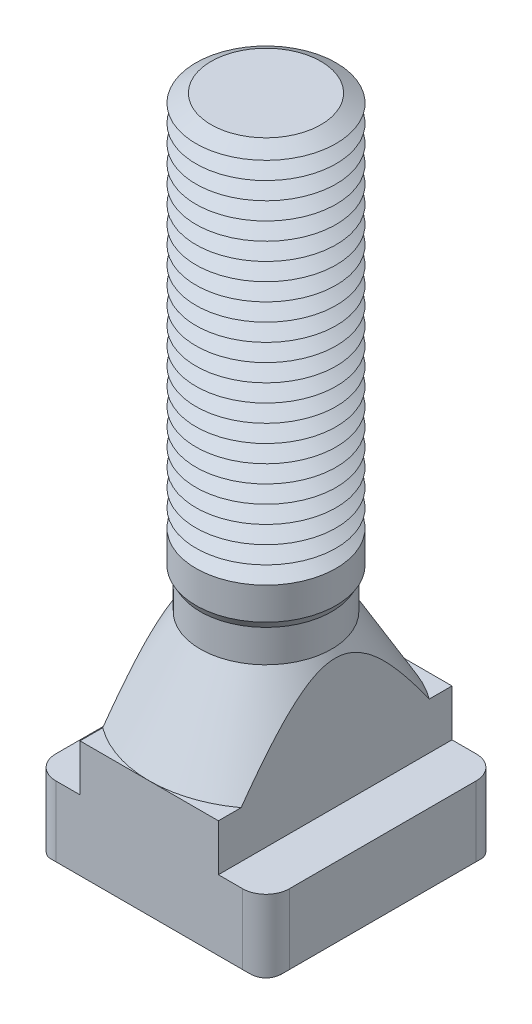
ISO-10303-21;
HEADER;
FILE_DESCRIPTION(('STEP AP214'),'2;1');
FILE_NAME('part.step','',(''),(''),'','','');
FILE_SCHEMA(('AUTOMOTIVE_DESIGN { 1 0 10303 214 1 1 1 1 }'));
ENDSEC;
DATA;
#1=APPLICATION_CONTEXT('core data for automotive mechanical design processes');
#2=APPLICATION_PROTOCOL_DEFINITION('international standard','automotive_design',2000,#1);
#3=PRODUCT_CONTEXT('',#1,'mechanical');
#4=PRODUCT('Part','Part','',(#3));
#5=PRODUCT_RELATED_PRODUCT_CATEGORY('part','',(#4));
#6=PRODUCT_DEFINITION_FORMATION('','',#4);
#7=PRODUCT_DEFINITION_CONTEXT('part definition',#1,'design');
#8=PRODUCT_DEFINITION('design','',#6,#7);
#9=PRODUCT_DEFINITION_SHAPE('','',#8);
#10=(LENGTH_UNIT() NAMED_UNIT(*) SI_UNIT(.MILLI.,.METRE.));
#11=(NAMED_UNIT(*) PLANE_ANGLE_UNIT() SI_UNIT($,.RADIAN.));
#12=(NAMED_UNIT(*) SI_UNIT($,.STERADIAN.) SOLID_ANGLE_UNIT());
#13=UNCERTAINTY_MEASURE_WITH_UNIT(LENGTH_MEASURE(1.E-05),#10,'distance_accuracy_value','');
#14=(GEOMETRIC_REPRESENTATION_CONTEXT(3) GLOBAL_UNCERTAINTY_ASSIGNED_CONTEXT((#13)) GLOBAL_UNIT_ASSIGNED_CONTEXT((#10,
#11,#12)) REPRESENTATION_CONTEXT('',''));
#15=CARTESIAN_POINT('',(0.,0.,0.));
#16=DIRECTION('',(0.,0.,1.));
#17=DIRECTION('',(1.,0.,0.));
#18=AXIS2_PLACEMENT_3D('',#15,#16,#17);
#19=CARTESIAN_POINT('',(0.,104.,0.));
#20=DIRECTION('',(0.,-1.,0.));
#21=DIRECTION('',(0.,0.,-1.));
#22=AXIS2_PLACEMENT_3D('',#19,#20,#21);
#23=CONICAL_SURFACE('',#22,9.40192378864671,1.0471975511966);
#24=CARTESIAN_POINT('',(0.,102.5,0.));
#25=DIRECTION('',(0.,-1.,0.));
#26=DIRECTION('',(0.,0.,-1.));
#27=AXIS2_PLACEMENT_3D('',#24,#25,#26);
#28=CIRCLE('',#27,12.);
#29=CARTESIAN_POINT('',(0.,102.5,-12.));
#30=VERTEX_POINT('',#29);
#31=EDGE_CURVE('E793',#30,#30,#28,.T.);
#32=ORIENTED_EDGE('',*,*,#31,.F.);
#33=EDGE_LOOP('',(#32));
#34=FACE_BOUND('',#33,.T.);
#35=CARTESIAN_POINT('',(0.,104.,0.));
#36=DIRECTION('',(0.,-1.,0.));
#37=DIRECTION('',(0.,0.,-1.));
#38=AXIS2_PLACEMENT_3D('',#35,#36,#37);
#39=CIRCLE('',#38,9.40192378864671);
#40=CARTESIAN_POINT('',(0.,104.,-9.40192378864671));
#41=VERTEX_POINT('',#40);
#42=EDGE_CURVE('E797',#41,#41,#39,.T.);
#43=ORIENTED_EDGE('',*,*,#42,.T.);
#44=EDGE_LOOP('',(#43));
#45=FACE_BOUND('',#44,.T.);
#46=ADVANCED_FACE('F39',(#34,#45),#23,.T.);
#47=CARTESIAN_POINT('',(0.,105.5,0.));
#48=DIRECTION('',(0.,1.,0.));
#49=DIRECTION('',(0.,0.,1.));
#50=AXIS2_PLACEMENT_3D('',#47,#48,#49);
#51=CONICAL_SURFACE('',#50,12.,1.0471975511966);
#52=ORIENTED_EDGE('',*,*,#42,.F.);
#53=EDGE_LOOP('',(#52));
#54=FACE_BOUND('',#53,.T.);
#55=CARTESIAN_POINT('',(0.,105.5,0.));
#56=DIRECTION('',(0.,-1.,0.));
#57=DIRECTION('',(0.,0.,-1.));
#58=AXIS2_PLACEMENT_3D('',#55,#56,#57);
#59=CIRCLE('',#58,12.);
#60=CARTESIAN_POINT('',(0.,105.5,-12.));
#61=VERTEX_POINT('',#60);
#62=EDGE_CURVE('E800',#61,#61,#59,.T.);
#63=ORIENTED_EDGE('',*,*,#62,.T.);
#64=EDGE_LOOP('',(#63));
#65=FACE_BOUND('',#64,.T.);
#66=ADVANCED_FACE('F448',(#54,#65),#51,.T.);
#67=CARTESIAN_POINT('',(4.88720956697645,116.,0.));
#68=DIRECTION('',(0.,-1.,0.));
#69=DIRECTION('',(1.,0.,0.));
#70=AXIS2_PLACEMENT_3D('',#67,#68,#69);
#71=PLANE('',#70);
#72=CARTESIAN_POINT('',(0.,116.,0.));
#73=DIRECTION('',(0.,-1.,0.));
#74=DIRECTION('',(0.,0.,-1.));
#75=AXIS2_PLACEMENT_3D('',#72,#73,#74);
#76=CIRCLE('',#75,9.40192378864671);
#77=CARTESIAN_POINT('',(0.,116.,-9.40192378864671));
#78=VERTEX_POINT('',#77);
#79=EDGE_CURVE('E660',#78,#78,#76,.T.);
#80=ORIENTED_EDGE('',*,*,#79,.F.);
#81=EDGE_LOOP('',(#80));
#82=FACE_BOUND('',#81,.T.);
#83=ADVANCED_FACE('F454',(#82),#71,.F.);
#84=CARTESIAN_POINT('',(0.,116.,0.));
#85=DIRECTION('',(0.,-1.,0.));
#86=DIRECTION('',(0.,0.,-1.));
#87=AXIS2_PLACEMENT_3D('',#84,#85,#86);
#88=CONICAL_SURFACE('',#87,9.40192378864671,1.0471975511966);
#89=CARTESIAN_POINT('',(0.,114.5,0.));
#90=DIRECTION('',(0.,-1.,0.));
#91=DIRECTION('',(0.,0.,-1.));
#92=AXIS2_PLACEMENT_3D('',#89,#90,#91);
#93=CIRCLE('',#92,12.);
#94=CARTESIAN_POINT('',(0.,114.5,-12.));
#95=VERTEX_POINT('',#94);
#96=EDGE_CURVE('E663',#95,#95,#93,.T.);
#97=ORIENTED_EDGE('',*,*,#96,.F.);
#98=EDGE_LOOP('',(#97));
#99=FACE_BOUND('',#98,.T.);
#100=ORIENTED_EDGE('',*,*,#79,.T.);
#101=EDGE_LOOP('',(#100));
#102=FACE_BOUND('',#101,.T.);
#103=ADVANCED_FACE('F482',(#99,#102),#88,.T.);
#104=CARTESIAN_POINT('',(0.,114.5,0.));
#105=DIRECTION('',(0.,1.,0.));
#106=DIRECTION('',(0.,0.,1.));
#107=AXIS2_PLACEMENT_3D('',#104,#105,#106);
#108=CONICAL_SURFACE('',#107,12.,1.0471975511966);
#109=CARTESIAN_POINT('',(0.,113.,0.));
#110=DIRECTION('',(0.,-1.,0.));
#111=DIRECTION('',(0.,0.,-1.));
#112=AXIS2_PLACEMENT_3D('',#109,#110,#111);
#113=CIRCLE('',#112,9.40192378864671);
#114=CARTESIAN_POINT('',(0.,113.,-9.40192378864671));
#115=VERTEX_POINT('',#114);
#116=EDGE_CURVE('E679',#115,#115,#113,.T.);
#117=ORIENTED_EDGE('',*,*,#116,.F.);
#118=EDGE_LOOP('',(#117));
#119=FACE_BOUND('',#118,.T.);
#120=ORIENTED_EDGE('',*,*,#96,.T.);
#121=EDGE_LOOP('',(#120));
#122=FACE_BOUND('',#121,.T.);
#123=ADVANCED_FACE('F479',(#119,#122),#108,.T.);
#124=CARTESIAN_POINT('',(0.,113.,0.));
#125=DIRECTION('',(0.,-1.,0.));
#126=DIRECTION('',(0.,0.,-1.));
#127=AXIS2_PLACEMENT_3D('',#124,#125,#126);
#128=CONICAL_SURFACE('',#127,9.40192378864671,1.0471975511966);
#129=CARTESIAN_POINT('',(0.,111.5,0.));
#130=DIRECTION('',(0.,-1.,0.));
#131=DIRECTION('',(0.,0.,-1.));
#132=AXIS2_PLACEMENT_3D('',#129,#130,#131);
#133=CIRCLE('',#132,12.);
#134=CARTESIAN_POINT('',(0.,111.5,-12.));
#135=VERTEX_POINT('',#134);
#136=EDGE_CURVE('E676',#135,#135,#133,.T.);
#137=ORIENTED_EDGE('',*,*,#136,.F.);
#138=EDGE_LOOP('',(#137));
#139=FACE_BOUND('',#138,.T.);
#140=ORIENTED_EDGE('',*,*,#116,.T.);
#141=EDGE_LOOP('',(#140));
#142=FACE_BOUND('',#141,.T.);
#143=ADVANCED_FACE('F474',(#139,#142),#128,.T.);
#144=CARTESIAN_POINT('',(0.,111.5,0.));
#145=DIRECTION('',(0.,1.,0.));
#146=DIRECTION('',(0.,0.,1.));
#147=AXIS2_PLACEMENT_3D('',#144,#145,#146);
#148=CONICAL_SURFACE('',#147,12.,1.0471975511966);
#149=CARTESIAN_POINT('',(0.,110.,0.));
#150=DIRECTION('',(0.,-1.,0.));
#151=DIRECTION('',(0.,0.,-1.));
#152=AXIS2_PLACEMENT_3D('',#149,#150,#151);
#153=CIRCLE('',#152,9.40192378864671);
#154=CARTESIAN_POINT('',(0.,110.,-9.40192378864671));
#155=VERTEX_POINT('',#154);
#156=EDGE_CURVE('E680',#155,#155,#153,.T.);
#157=ORIENTED_EDGE('',*,*,#156,.F.);
#158=EDGE_LOOP('',(#157));
#159=FACE_BOUND('',#158,.T.);
#160=ORIENTED_EDGE('',*,*,#136,.T.);
#161=EDGE_LOOP('',(#160));
#162=FACE_BOUND('',#161,.T.);
#163=ADVANCED_FACE('F471',(#159,#162),#148,.T.);
#164=CARTESIAN_POINT('',(0.,110.,0.));
#165=DIRECTION('',(0.,-1.,0.));
#166=DIRECTION('',(0.,0.,-1.));
#167=AXIS2_PLACEMENT_3D('',#164,#165,#166);
#168=CONICAL_SURFACE('',#167,9.40192378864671,1.0471975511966);
#169=CARTESIAN_POINT('',(0.,108.5,0.));
#170=DIRECTION('',(0.,-1.,0.));
#171=DIRECTION('',(0.,0.,-1.));
#172=AXIS2_PLACEMENT_3D('',#169,#170,#171);
#173=CIRCLE('',#172,12.);
#174=CARTESIAN_POINT('',(0.,108.5,-12.));
#175=VERTEX_POINT('',#174);
#176=EDGE_CURVE('E697',#175,#175,#173,.T.);
#177=ORIENTED_EDGE('',*,*,#176,.F.);
#178=EDGE_LOOP('',(#177));
#179=FACE_BOUND('',#178,.T.);
#180=ORIENTED_EDGE('',*,*,#156,.T.);
#181=EDGE_LOOP('',(#180));
#182=FACE_BOUND('',#181,.T.);
#183=ADVANCED_FACE('F465',(#179,#182),#168,.T.);
#184=CARTESIAN_POINT('',(0.,108.5,0.));
#185=DIRECTION('',(0.,1.,0.));
#186=DIRECTION('',(0.,0.,1.));
#187=AXIS2_PLACEMENT_3D('',#184,#185,#186);
#188=CONICAL_SURFACE('',#187,12.,1.0471975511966);
#189=CARTESIAN_POINT('',(0.,107.,0.));
#190=DIRECTION('',(0.,-1.,0.));
#191=DIRECTION('',(0.,0.,-1.));
#192=AXIS2_PLACEMENT_3D('',#189,#190,#191);
#193=CIRCLE('',#192,9.40192378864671);
#194=CARTESIAN_POINT('',(0.,107.,-9.40192378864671));
#195=VERTEX_POINT('',#194);
#196=EDGE_CURVE('E699',#195,#195,#193,.T.);
#197=ORIENTED_EDGE('',*,*,#196,.F.);
#198=EDGE_LOOP('',(#197));
#199=FACE_BOUND('',#198,.T.);
#200=ORIENTED_EDGE('',*,*,#176,.T.);
#201=EDGE_LOOP('',(#200));
#202=FACE_BOUND('',#201,.T.);
#203=ADVANCED_FACE('F461',(#199,#202),#188,.T.);
#204=CARTESIAN_POINT('',(0.,107.,0.));
#205=DIRECTION('',(0.,-1.,0.));
#206=DIRECTION('',(0.,0.,-1.));
#207=AXIS2_PLACEMENT_3D('',#204,#205,#206);
#208=CONICAL_SURFACE('',#207,9.40192378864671,1.0471975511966);
#209=ORIENTED_EDGE('',*,*,#62,.F.);
#210=EDGE_LOOP('',(#209));
#211=FACE_BOUND('',#210,.T.);
#212=ORIENTED_EDGE('',*,*,#196,.T.);
#213=EDGE_LOOP('',(#212));
#214=FACE_BOUND('',#213,.T.);
#215=ADVANCED_FACE('F464',(#211,#214),#208,.T.);
#216=CARTESIAN_POINT('',(0.,101.,0.));
#217=DIRECTION('',(0.,-1.,0.));
#218=DIRECTION('',(0.,0.,-1.));
#219=AXIS2_PLACEMENT_3D('',#216,#217,#218);
#220=CONICAL_SURFACE('',#219,9.40192378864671,1.0471975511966);
#221=CARTESIAN_POINT('',(0.,99.5,0.));
#222=DIRECTION('',(0.,-1.,0.));
#223=DIRECTION('',(0.,0.,-1.));
#224=AXIS2_PLACEMENT_3D('',#221,#222,#223);
#225=CIRCLE('',#224,12.);
#226=CARTESIAN_POINT('',(0.,99.5,-12.));
#227=VERTEX_POINT('',#226);
#228=EDGE_CURVE('E642',#227,#227,#225,.T.);
#229=ORIENTED_EDGE('',*,*,#228,.F.);
#230=EDGE_LOOP('',(#229));
#231=FACE_BOUND('',#230,.T.);
#232=CARTESIAN_POINT('',(0.,101.,0.));
#233=DIRECTION('',(0.,-1.,0.));
#234=DIRECTION('',(0.,0.,-1.));
#235=AXIS2_PLACEMENT_3D('',#232,#233,#234);
#236=CIRCLE('',#235,9.40192378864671);
#237=CARTESIAN_POINT('',(0.,101.,-9.40192378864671));
#238=VERTEX_POINT('',#237);
#239=EDGE_CURVE('E644',#238,#238,#236,.T.);
#240=ORIENTED_EDGE('',*,*,#239,.T.);
#241=EDGE_LOOP('',(#240));
#242=FACE_BOUND('',#241,.T.);
#243=ADVANCED_FACE('F469',(#231,#242),#220,.T.);
#244=CARTESIAN_POINT('',(0.,102.5,0.));
#245=DIRECTION('',(0.,1.,0.));
#246=DIRECTION('',(0.,0.,1.));
#247=AXIS2_PLACEMENT_3D('',#244,#245,#246);
#248=CONICAL_SURFACE('',#247,12.,1.0471975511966);
#249=ORIENTED_EDGE('',*,*,#239,.F.);
#250=EDGE_LOOP('',(#249));
#251=FACE_BOUND('',#250,.T.);
#252=ORIENTED_EDGE('',*,*,#31,.T.);
#253=EDGE_LOOP('',(#252));
#254=FACE_BOUND('',#253,.T.);
#255=ADVANCED_FACE('F1267',(#251,#254),#248,.T.);
#256=CARTESIAN_POINT('',(0.,98.,0.));
#257=DIRECTION('',(0.,-1.,0.));
#258=DIRECTION('',(0.,0.,-1.));
#259=AXIS2_PLACEMENT_3D('',#256,#257,#258);
#260=CONICAL_SURFACE('',#259,9.40192378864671,1.0471975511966);
#261=CARTESIAN_POINT('',(0.,96.5,0.));
#262=DIRECTION('',(0.,-1.,0.));
#263=DIRECTION('',(0.,0.,-1.));
#264=AXIS2_PLACEMENT_3D('',#261,#262,#263);
#265=CIRCLE('',#264,12.);
#266=CARTESIAN_POINT('',(0.,96.5,-12.));
#267=VERTEX_POINT('',#266);
#268=EDGE_CURVE('E695',#267,#267,#265,.T.);
#269=ORIENTED_EDGE('',*,*,#268,.F.);
#270=EDGE_LOOP('',(#269));
#271=FACE_BOUND('',#270,.T.);
#272=CARTESIAN_POINT('',(0.,98.,0.));
#273=DIRECTION('',(0.,-1.,0.));
#274=DIRECTION('',(0.,0.,-1.));
#275=AXIS2_PLACEMENT_3D('',#272,#273,#274);
#276=CIRCLE('',#275,9.40192378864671);
#277=CARTESIAN_POINT('',(0.,98.,-9.40192378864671));
#278=VERTEX_POINT('',#277);
#279=EDGE_CURVE('E645',#278,#278,#276,.T.);
#280=ORIENTED_EDGE('',*,*,#279,.T.);
#281=EDGE_LOOP('',(#280));
#282=FACE_BOUND('',#281,.T.);
#283=ADVANCED_FACE('F1257',(#271,#282),#260,.T.);
#284=CARTESIAN_POINT('',(0.,99.5,0.));
#285=DIRECTION('',(0.,1.,0.));
#286=DIRECTION('',(0.,0.,1.));
#287=AXIS2_PLACEMENT_3D('',#284,#285,#286);
#288=CONICAL_SURFACE('',#287,12.,1.0471975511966);
#289=ORIENTED_EDGE('',*,*,#279,.F.);
#290=EDGE_LOOP('',(#289));
#291=FACE_BOUND('',#290,.T.);
#292=ORIENTED_EDGE('',*,*,#228,.T.);
#293=EDGE_LOOP('',(#292));
#294=FACE_BOUND('',#293,.T.);
#295=ADVANCED_FACE('F1247',(#291,#294),#288,.T.);
#296=CARTESIAN_POINT('',(0.,95.,0.));
#297=DIRECTION('',(0.,-1.,0.));
#298=DIRECTION('',(0.,0.,-1.));
#299=AXIS2_PLACEMENT_3D('',#296,#297,#298);
#300=CONICAL_SURFACE('',#299,9.40192378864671,1.0471975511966);
#301=CARTESIAN_POINT('',(0.,93.5,0.));
#302=DIRECTION('',(0.,-1.,0.));
#303=DIRECTION('',(0.,0.,-1.));
#304=AXIS2_PLACEMENT_3D('',#301,#302,#303);
#305=CIRCLE('',#304,12.);
#306=CARTESIAN_POINT('',(0.,93.5,-12.));
#307=VERTEX_POINT('',#306);
#308=EDGE_CURVE('E673',#307,#307,#305,.T.);
#309=ORIENTED_EDGE('',*,*,#308,.F.);
#310=EDGE_LOOP('',(#309));
#311=FACE_BOUND('',#310,.T.);
#312=CARTESIAN_POINT('',(0.,95.,0.));
#313=DIRECTION('',(0.,-1.,0.));
#314=DIRECTION('',(0.,0.,-1.));
#315=AXIS2_PLACEMENT_3D('',#312,#313,#314);
#316=CIRCLE('',#315,9.40192378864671);
#317=CARTESIAN_POINT('',(0.,95.,-9.40192378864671));
#318=VERTEX_POINT('',#317);
#319=EDGE_CURVE('E692',#318,#318,#316,.T.);
#320=ORIENTED_EDGE('',*,*,#319,.T.);
#321=EDGE_LOOP('',(#320));
#322=FACE_BOUND('',#321,.T.);
#323=ADVANCED_FACE('F1237',(#311,#322),#300,.T.);
#324=CARTESIAN_POINT('',(0.,96.5,0.));
#325=DIRECTION('',(0.,1.,0.));
#326=DIRECTION('',(0.,0.,1.));
#327=AXIS2_PLACEMENT_3D('',#324,#325,#326);
#328=CONICAL_SURFACE('',#327,12.,1.0471975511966);
#329=ORIENTED_EDGE('',*,*,#319,.F.);
#330=EDGE_LOOP('',(#329));
#331=FACE_BOUND('',#330,.T.);
#332=ORIENTED_EDGE('',*,*,#268,.T.);
#333=EDGE_LOOP('',(#332));
#334=FACE_BOUND('',#333,.T.);
#335=ADVANCED_FACE('F1227',(#331,#334),#328,.T.);
#336=CARTESIAN_POINT('',(0.,92.,0.));
#337=DIRECTION('',(0.,-1.,0.));
#338=DIRECTION('',(0.,0.,-1.));
#339=AXIS2_PLACEMENT_3D('',#336,#337,#338);
#340=CONICAL_SURFACE('',#339,9.40192378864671,1.0471975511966);
#341=CARTESIAN_POINT('',(0.,90.5,0.));
#342=DIRECTION('',(0.,-1.,0.));
#343=DIRECTION('',(0.,0.,-1.));
#344=AXIS2_PLACEMENT_3D('',#341,#342,#343);
#345=CIRCLE('',#344,12.);
#346=CARTESIAN_POINT('',(0.,90.5,-12.));
#347=VERTEX_POINT('',#346);
#348=EDGE_CURVE('E674',#347,#347,#345,.T.);
#349=ORIENTED_EDGE('',*,*,#348,.F.);
#350=EDGE_LOOP('',(#349));
#351=FACE_BOUND('',#350,.T.);
#352=CARTESIAN_POINT('',(0.,92.,0.));
#353=DIRECTION('',(0.,-1.,0.));
#354=DIRECTION('',(0.,0.,-1.));
#355=AXIS2_PLACEMENT_3D('',#352,#353,#354);
#356=CIRCLE('',#355,9.40192378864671);
#357=CARTESIAN_POINT('',(0.,92.,-9.40192378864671));
#358=VERTEX_POINT('',#357);
#359=EDGE_CURVE('E670',#358,#358,#356,.T.);
#360=ORIENTED_EDGE('',*,*,#359,.T.);
#361=EDGE_LOOP('',(#360));
#362=FACE_BOUND('',#361,.T.);
#363=ADVANCED_FACE('F1217',(#351,#362),#340,.T.);
#364=CARTESIAN_POINT('',(0.,93.5,0.));
#365=DIRECTION('',(0.,1.,0.));
#366=DIRECTION('',(0.,0.,1.));
#367=AXIS2_PLACEMENT_3D('',#364,#365,#366);
#368=CONICAL_SURFACE('',#367,12.,1.0471975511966);
#369=ORIENTED_EDGE('',*,*,#359,.F.);
#370=EDGE_LOOP('',(#369));
#371=FACE_BOUND('',#370,.T.);
#372=ORIENTED_EDGE('',*,*,#308,.T.);
#373=EDGE_LOOP('',(#372));
#374=FACE_BOUND('',#373,.T.);
#375=ADVANCED_FACE('F1207',(#371,#374),#368,.T.);
#376=CARTESIAN_POINT('',(0.,89.,0.));
#377=DIRECTION('',(0.,-1.,0.));
#378=DIRECTION('',(0.,0.,-1.));
#379=AXIS2_PLACEMENT_3D('',#376,#377,#378);
#380=CONICAL_SURFACE('',#379,9.40192378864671,1.0471975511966);
#381=CARTESIAN_POINT('',(0.,87.5,0.));
#382=DIRECTION('',(0.,-1.,0.));
#383=DIRECTION('',(0.,0.,-1.));
#384=AXIS2_PLACEMENT_3D('',#381,#382,#383);
#385=CIRCLE('',#384,12.);
#386=CARTESIAN_POINT('',(0.,87.5,-12.));
#387=VERTEX_POINT('',#386);
#388=EDGE_CURVE('E770',#387,#387,#385,.T.);
#389=ORIENTED_EDGE('',*,*,#388,.F.);
#390=EDGE_LOOP('',(#389));
#391=FACE_BOUND('',#390,.T.);
#392=CARTESIAN_POINT('',(0.,89.,0.));
#393=DIRECTION('',(0.,-1.,0.));
#394=DIRECTION('',(0.,0.,-1.));
#395=AXIS2_PLACEMENT_3D('',#392,#393,#394);
#396=CIRCLE('',#395,9.40192378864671);
#397=CARTESIAN_POINT('',(0.,89.,-9.40192378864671));
#398=VERTEX_POINT('',#397);
#399=EDGE_CURVE('E774',#398,#398,#396,.T.);
#400=ORIENTED_EDGE('',*,*,#399,.T.);
#401=EDGE_LOOP('',(#400));
#402=FACE_BOUND('',#401,.T.);
#403=ADVANCED_FACE('F1197',(#391,#402),#380,.T.);
#404=CARTESIAN_POINT('',(0.,90.5,0.));
#405=DIRECTION('',(0.,1.,0.));
#406=DIRECTION('',(0.,0.,1.));
#407=AXIS2_PLACEMENT_3D('',#404,#405,#406);
#408=CONICAL_SURFACE('',#407,12.,1.0471975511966);
#409=ORIENTED_EDGE('',*,*,#399,.F.);
#410=EDGE_LOOP('',(#409));
#411=FACE_BOUND('',#410,.T.);
#412=ORIENTED_EDGE('',*,*,#348,.T.);
#413=EDGE_LOOP('',(#412));
#414=FACE_BOUND('',#413,.T.);
#415=ADVANCED_FACE('F1187',(#411,#414),#408,.T.);
#416=CARTESIAN_POINT('',(0.,86.,0.));
#417=DIRECTION('',(0.,-1.,0.));
#418=DIRECTION('',(0.,0.,-1.));
#419=AXIS2_PLACEMENT_3D('',#416,#417,#418);
#420=CONICAL_SURFACE('',#419,9.40192378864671,1.0471975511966);
#421=CARTESIAN_POINT('',(0.,84.5,0.));
#422=DIRECTION('',(0.,-1.,0.));
#423=DIRECTION('',(0.,0.,-1.));
#424=AXIS2_PLACEMENT_3D('',#421,#422,#423);
#425=CIRCLE('',#424,12.);
#426=CARTESIAN_POINT('',(0.,84.5,-12.));
#427=VERTEX_POINT('',#426);
#428=EDGE_CURVE('E657',#427,#427,#425,.T.);
#429=ORIENTED_EDGE('',*,*,#428,.F.);
#430=EDGE_LOOP('',(#429));
#431=FACE_BOUND('',#430,.T.);
#432=CARTESIAN_POINT('',(0.,86.,0.));
#433=DIRECTION('',(0.,-1.,0.));
#434=DIRECTION('',(0.,0.,-1.));
#435=AXIS2_PLACEMENT_3D('',#432,#433,#434);
#436=CIRCLE('',#435,9.40192378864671);
#437=CARTESIAN_POINT('',(0.,86.,-9.40192378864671));
#438=VERTEX_POINT('',#437);
#439=EDGE_CURVE('E766',#438,#438,#436,.T.);
#440=ORIENTED_EDGE('',*,*,#439,.T.);
#441=EDGE_LOOP('',(#440));
#442=FACE_BOUND('',#441,.T.);
#443=ADVANCED_FACE('F1177',(#431,#442),#420,.T.);
#444=CARTESIAN_POINT('',(0.,87.5,0.));
#445=DIRECTION('',(0.,1.,0.));
#446=DIRECTION('',(0.,0.,1.));
#447=AXIS2_PLACEMENT_3D('',#444,#445,#446);
#448=CONICAL_SURFACE('',#447,12.,1.0471975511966);
#449=ORIENTED_EDGE('',*,*,#439,.F.);
#450=EDGE_LOOP('',(#449));
#451=FACE_BOUND('',#450,.T.);
#452=ORIENTED_EDGE('',*,*,#388,.T.);
#453=EDGE_LOOP('',(#452));
#454=FACE_BOUND('',#453,.T.);
#455=ADVANCED_FACE('F1167',(#451,#454),#448,.T.);
#456=CARTESIAN_POINT('',(0.,83.,0.));
#457=DIRECTION('',(0.,-1.,0.));
#458=DIRECTION('',(0.,0.,-1.));
#459=AXIS2_PLACEMENT_3D('',#456,#457,#458);
#460=CONICAL_SURFACE('',#459,9.40192378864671,1.0471975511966);
#461=CARTESIAN_POINT('',(0.,81.5,0.));
#462=DIRECTION('',(0.,-1.,0.));
#463=DIRECTION('',(0.,0.,-1.));
#464=AXIS2_PLACEMENT_3D('',#461,#462,#463);
#465=CIRCLE('',#464,12.);
#466=CARTESIAN_POINT('',(0.,81.5,-12.));
#467=VERTEX_POINT('',#466);
#468=EDGE_CURVE('E658',#467,#467,#465,.T.);
#469=ORIENTED_EDGE('',*,*,#468,.F.);
#470=EDGE_LOOP('',(#469));
#471=FACE_BOUND('',#470,.T.);
#472=CARTESIAN_POINT('',(0.,83.,0.));
#473=DIRECTION('',(0.,-1.,0.));
#474=DIRECTION('',(0.,0.,-1.));
#475=AXIS2_PLACEMENT_3D('',#472,#473,#474);
#476=CIRCLE('',#475,9.40192378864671);
#477=CARTESIAN_POINT('',(0.,83.,-9.40192378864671));
#478=VERTEX_POINT('',#477);
#479=EDGE_CURVE('E654',#478,#478,#476,.T.);
#480=ORIENTED_EDGE('',*,*,#479,.T.);
#481=EDGE_LOOP('',(#480));
#482=FACE_BOUND('',#481,.T.);
#483=ADVANCED_FACE('F1157',(#471,#482),#460,.T.);
#484=CARTESIAN_POINT('',(0.,84.5,0.));
#485=DIRECTION('',(0.,1.,0.));
#486=DIRECTION('',(0.,0.,1.));
#487=AXIS2_PLACEMENT_3D('',#484,#485,#486);
#488=CONICAL_SURFACE('',#487,12.,1.0471975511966);
#489=ORIENTED_EDGE('',*,*,#479,.F.);
#490=EDGE_LOOP('',(#489));
#491=FACE_BOUND('',#490,.T.);
#492=ORIENTED_EDGE('',*,*,#428,.T.);
#493=EDGE_LOOP('',(#492));
#494=FACE_BOUND('',#493,.T.);
#495=ADVANCED_FACE('F1147',(#491,#494),#488,.T.);
#496=CARTESIAN_POINT('',(0.,80.,0.));
#497=DIRECTION('',(0.,-1.,0.));
#498=DIRECTION('',(0.,0.,-1.));
#499=AXIS2_PLACEMENT_3D('',#496,#497,#498);
#500=CONICAL_SURFACE('',#499,9.40192378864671,1.0471975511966);
#501=CARTESIAN_POINT('',(0.,78.5,0.));
#502=DIRECTION('',(0.,-1.,0.));
#503=DIRECTION('',(0.,0.,-1.));
#504=AXIS2_PLACEMENT_3D('',#501,#502,#503);
#505=CIRCLE('',#504,12.);
#506=CARTESIAN_POINT('',(0.,78.5,-12.));
#507=VERTEX_POINT('',#506);
#508=EDGE_CURVE('E756',#507,#507,#505,.T.);
#509=ORIENTED_EDGE('',*,*,#508,.F.);
#510=EDGE_LOOP('',(#509));
#511=FACE_BOUND('',#510,.T.);
#512=CARTESIAN_POINT('',(0.,80.,0.));
#513=DIRECTION('',(0.,-1.,0.));
#514=DIRECTION('',(0.,0.,-1.));
#515=AXIS2_PLACEMENT_3D('',#512,#513,#514);
#516=CIRCLE('',#515,9.40192378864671);
#517=CARTESIAN_POINT('',(0.,80.,-9.40192378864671));
#518=VERTEX_POINT('',#517);
#519=EDGE_CURVE('E668',#518,#518,#516,.T.);
#520=ORIENTED_EDGE('',*,*,#519,.T.);
#521=EDGE_LOOP('',(#520));
#522=FACE_BOUND('',#521,.T.);
#523=ADVANCED_FACE('F1137',(#511,#522),#500,.T.);
#524=CARTESIAN_POINT('',(0.,81.5,0.));
#525=DIRECTION('',(0.,1.,0.));
#526=DIRECTION('',(0.,0.,1.));
#527=AXIS2_PLACEMENT_3D('',#524,#525,#526);
#528=CONICAL_SURFACE('',#527,12.,1.0471975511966);
#529=ORIENTED_EDGE('',*,*,#519,.F.);
#530=EDGE_LOOP('',(#529));
#531=FACE_BOUND('',#530,.T.);
#532=ORIENTED_EDGE('',*,*,#468,.T.);
#533=EDGE_LOOP('',(#532));
#534=FACE_BOUND('',#533,.T.);
#535=ADVANCED_FACE('F1127',(#531,#534),#528,.T.);
#536=CARTESIAN_POINT('',(0.,77.,0.));
#537=DIRECTION('',(0.,-1.,0.));
#538=DIRECTION('',(0.,0.,-1.));
#539=AXIS2_PLACEMENT_3D('',#536,#537,#538);
#540=CONICAL_SURFACE('',#539,9.40192378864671,1.0471975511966);
#541=CARTESIAN_POINT('',(0.,75.5,0.));
#542=DIRECTION('',(0.,-1.,0.));
#543=DIRECTION('',(0.,0.,-1.));
#544=AXIS2_PLACEMENT_3D('',#541,#542,#543);
#545=CIRCLE('',#544,12.);
#546=CARTESIAN_POINT('',(0.,75.5,-12.));
#547=VERTEX_POINT('',#546);
#548=EDGE_CURVE('E636',#547,#547,#545,.T.);
#549=ORIENTED_EDGE('',*,*,#548,.F.);
#550=EDGE_LOOP('',(#549));
#551=FACE_BOUND('',#550,.T.);
#552=CARTESIAN_POINT('',(0.,77.,0.));
#553=DIRECTION('',(0.,-1.,0.));
#554=DIRECTION('',(0.,0.,-1.));
#555=AXIS2_PLACEMENT_3D('',#552,#553,#554);
#556=CIRCLE('',#555,9.40192378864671);
#557=CARTESIAN_POINT('',(0.,77.,-9.40192378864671));
#558=VERTEX_POINT('',#557);
#559=EDGE_CURVE('E639',#558,#558,#556,.T.);
#560=ORIENTED_EDGE('',*,*,#559,.T.);
#561=EDGE_LOOP('',(#560));
#562=FACE_BOUND('',#561,.T.);
#563=ADVANCED_FACE('F1117',(#551,#562),#540,.T.);
#564=CARTESIAN_POINT('',(0.,78.5,0.));
#565=DIRECTION('',(0.,1.,0.));
#566=DIRECTION('',(0.,0.,1.));
#567=AXIS2_PLACEMENT_3D('',#564,#565,#566);
#568=CONICAL_SURFACE('',#567,12.,1.0471975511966);
#569=ORIENTED_EDGE('',*,*,#559,.F.);
#570=EDGE_LOOP('',(#569));
#571=FACE_BOUND('',#570,.T.);
#572=ORIENTED_EDGE('',*,*,#508,.T.);
#573=EDGE_LOOP('',(#572));
#574=FACE_BOUND('',#573,.T.);
#575=ADVANCED_FACE('F1107',(#571,#574),#568,.T.);
#576=CARTESIAN_POINT('',(0.,74.,0.));
#577=DIRECTION('',(0.,-1.,0.));
#578=DIRECTION('',(0.,0.,-1.));
#579=AXIS2_PLACEMENT_3D('',#576,#577,#578);
#580=CONICAL_SURFACE('',#579,9.40192378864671,1.0471975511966);
#581=CARTESIAN_POINT('',(0.,72.5,0.));
#582=DIRECTION('',(0.,-1.,0.));
#583=DIRECTION('',(0.,0.,-1.));
#584=AXIS2_PLACEMENT_3D('',#581,#582,#583);
#585=CIRCLE('',#584,12.);
#586=CARTESIAN_POINT('',(0.,72.5,-12.));
#587=VERTEX_POINT('',#586);
#588=EDGE_CURVE('E746',#587,#587,#585,.T.);
#589=ORIENTED_EDGE('',*,*,#588,.F.);
#590=EDGE_LOOP('',(#589));
#591=FACE_BOUND('',#590,.T.);
#592=CARTESIAN_POINT('',(0.,74.,0.));
#593=DIRECTION('',(0.,-1.,0.));
#594=DIRECTION('',(0.,0.,-1.));
#595=AXIS2_PLACEMENT_3D('',#592,#593,#594);
#596=CIRCLE('',#595,9.40192378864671);
#597=CARTESIAN_POINT('',(0.,74.,-9.40192378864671));
#598=VERTEX_POINT('',#597);
#599=EDGE_CURVE('E640',#598,#598,#596,.T.);
#600=ORIENTED_EDGE('',*,*,#599,.T.);
#601=EDGE_LOOP('',(#600));
#602=FACE_BOUND('',#601,.T.);
#603=ADVANCED_FACE('F1097',(#591,#602),#580,.T.);
#604=CARTESIAN_POINT('',(0.,75.5,0.));
#605=DIRECTION('',(0.,1.,0.));
#606=DIRECTION('',(0.,0.,1.));
#607=AXIS2_PLACEMENT_3D('',#604,#605,#606);
#608=CONICAL_SURFACE('',#607,12.,1.0471975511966);
#609=ORIENTED_EDGE('',*,*,#599,.F.);
#610=EDGE_LOOP('',(#609));
#611=FACE_BOUND('',#610,.T.);
#612=ORIENTED_EDGE('',*,*,#548,.T.);
#613=EDGE_LOOP('',(#612));
#614=FACE_BOUND('',#613,.T.);
#615=ADVANCED_FACE('F1087',(#611,#614),#608,.T.);
#616=CARTESIAN_POINT('',(0.,71.,0.));
#617=DIRECTION('',(0.,-1.,0.));
#618=DIRECTION('',(0.,0.,-1.));
#619=AXIS2_PLACEMENT_3D('',#616,#617,#618);
#620=CONICAL_SURFACE('',#619,9.40192378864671,1.0471975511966);
#621=CARTESIAN_POINT('',(0.,69.5,0.));
#622=DIRECTION('',(0.,-1.,0.));
#623=DIRECTION('',(0.,0.,-1.));
#624=AXIS2_PLACEMENT_3D('',#621,#622,#623);
#625=CIRCLE('',#624,12.);
#626=CARTESIAN_POINT('',(0.,69.5,-12.));
#627=VERTEX_POINT('',#626);
#628=EDGE_CURVE('E738',#627,#627,#625,.T.);
#629=ORIENTED_EDGE('',*,*,#628,.F.);
#630=EDGE_LOOP('',(#629));
#631=FACE_BOUND('',#630,.T.);
#632=CARTESIAN_POINT('',(0.,71.,0.));
#633=DIRECTION('',(0.,-1.,0.));
#634=DIRECTION('',(0.,0.,-1.));
#635=AXIS2_PLACEMENT_3D('',#632,#633,#634);
#636=CIRCLE('',#635,9.40192378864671);
#637=CARTESIAN_POINT('',(0.,71.,-9.40192378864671));
#638=VERTEX_POINT('',#637);
#639=EDGE_CURVE('E742',#638,#638,#636,.T.);
#640=ORIENTED_EDGE('',*,*,#639,.T.);
#641=EDGE_LOOP('',(#640));
#642=FACE_BOUND('',#641,.T.);
#643=ADVANCED_FACE('F1077',(#631,#642),#620,.T.);
#644=CARTESIAN_POINT('',(0.,72.5,0.));
#645=DIRECTION('',(0.,1.,0.));
#646=DIRECTION('',(0.,0.,1.));
#647=AXIS2_PLACEMENT_3D('',#644,#645,#646);
#648=CONICAL_SURFACE('',#647,12.,1.0471975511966);
#649=ORIENTED_EDGE('',*,*,#639,.F.);
#650=EDGE_LOOP('',(#649));
#651=FACE_BOUND('',#650,.T.);
#652=ORIENTED_EDGE('',*,*,#588,.T.);
#653=EDGE_LOOP('',(#652));
#654=FACE_BOUND('',#653,.T.);
#655=ADVANCED_FACE('F1067',(#651,#654),#648,.T.);
#656=CARTESIAN_POINT('',(0.,68.,0.));
#657=DIRECTION('',(0.,-1.,0.));
#658=DIRECTION('',(0.,0.,-1.));
#659=AXIS2_PLACEMENT_3D('',#656,#657,#658);
#660=CONICAL_SURFACE('',#659,9.40192378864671,1.0471975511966);
#661=CARTESIAN_POINT('',(0.,66.5,0.));
#662=DIRECTION('',(0.,-1.,0.));
#663=DIRECTION('',(0.,0.,-1.));
#664=AXIS2_PLACEMENT_3D('',#661,#662,#663);
#665=CIRCLE('',#664,12.);
#666=CARTESIAN_POINT('',(0.,66.5,-12.));
#667=VERTEX_POINT('',#666);
#668=EDGE_CURVE('E686',#667,#667,#665,.T.);
#669=ORIENTED_EDGE('',*,*,#668,.F.);
#670=EDGE_LOOP('',(#669));
#671=FACE_BOUND('',#670,.T.);
#672=CARTESIAN_POINT('',(0.,68.,0.));
#673=DIRECTION('',(0.,-1.,0.));
#674=DIRECTION('',(0.,0.,-1.));
#675=AXIS2_PLACEMENT_3D('',#672,#673,#674);
#676=CIRCLE('',#675,9.40192378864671);
#677=CARTESIAN_POINT('',(0.,68.,-9.40192378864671));
#678=VERTEX_POINT('',#677);
#679=EDGE_CURVE('E689',#678,#678,#676,.T.);
#680=ORIENTED_EDGE('',*,*,#679,.T.);
#681=EDGE_LOOP('',(#680));
#682=FACE_BOUND('',#681,.T.);
#683=ADVANCED_FACE('F1057',(#671,#682),#660,.T.);
#684=CARTESIAN_POINT('',(0.,69.5,0.));
#685=DIRECTION('',(0.,1.,0.));
#686=DIRECTION('',(0.,0.,1.));
#687=AXIS2_PLACEMENT_3D('',#684,#685,#686);
#688=CONICAL_SURFACE('',#687,12.,1.0471975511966);
#689=ORIENTED_EDGE('',*,*,#679,.F.);
#690=EDGE_LOOP('',(#689));
#691=FACE_BOUND('',#690,.T.);
#692=ORIENTED_EDGE('',*,*,#628,.T.);
#693=EDGE_LOOP('',(#692));
#694=FACE_BOUND('',#693,.T.);
#695=ADVANCED_FACE('F1047',(#691,#694),#688,.T.);
#696=CARTESIAN_POINT('',(0.,65.,0.));
#697=DIRECTION('',(0.,-1.,0.));
#698=DIRECTION('',(0.,0.,-1.));
#699=AXIS2_PLACEMENT_3D('',#696,#697,#698);
#700=CONICAL_SURFACE('',#699,9.40192378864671,1.0471975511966);
#701=CARTESIAN_POINT('',(0.,63.5,0.));
#702=DIRECTION('',(0.,-1.,0.));
#703=DIRECTION('',(0.,0.,-1.));
#704=AXIS2_PLACEMENT_3D('',#701,#702,#703);
#705=CIRCLE('',#704,12.);
#706=CARTESIAN_POINT('',(0.,63.5,-12.));
#707=VERTEX_POINT('',#706);
#708=EDGE_CURVE('E728',#707,#707,#705,.T.);
#709=ORIENTED_EDGE('',*,*,#708,.F.);
#710=EDGE_LOOP('',(#709));
#711=FACE_BOUND('',#710,.T.);
#712=CARTESIAN_POINT('',(0.,65.,0.));
#713=DIRECTION('',(0.,-1.,0.));
#714=DIRECTION('',(0.,0.,-1.));
#715=AXIS2_PLACEMENT_3D('',#712,#713,#714);
#716=CIRCLE('',#715,9.40192378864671);
#717=CARTESIAN_POINT('',(0.,65.,-9.40192378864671));
#718=VERTEX_POINT('',#717);
#719=EDGE_CURVE('E690',#718,#718,#716,.T.);
#720=ORIENTED_EDGE('',*,*,#719,.T.);
#721=EDGE_LOOP('',(#720));
#722=FACE_BOUND('',#721,.T.);
#723=ADVANCED_FACE('F1037',(#711,#722),#700,.T.);
#724=CARTESIAN_POINT('',(0.,66.5,0.));
#725=DIRECTION('',(0.,1.,0.));
#726=DIRECTION('',(0.,0.,1.));
#727=AXIS2_PLACEMENT_3D('',#724,#725,#726);
#728=CONICAL_SURFACE('',#727,12.,1.0471975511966);
#729=ORIENTED_EDGE('',*,*,#719,.F.);
#730=EDGE_LOOP('',(#729));
#731=FACE_BOUND('',#730,.T.);
#732=ORIENTED_EDGE('',*,*,#668,.T.);
#733=EDGE_LOOP('',(#732));
#734=FACE_BOUND('',#733,.T.);
#735=ADVANCED_FACE('F1027',(#731,#734),#728,.T.);
#736=CARTESIAN_POINT('',(0.,62.,0.));
#737=DIRECTION('',(0.,-1.,0.));
#738=DIRECTION('',(0.,0.,-1.));
#739=AXIS2_PLACEMENT_3D('',#736,#737,#738);
#740=CONICAL_SURFACE('',#739,9.40192378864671,1.0471975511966);
#741=CARTESIAN_POINT('',(0.,60.5,0.));
#742=DIRECTION('',(0.,-1.,0.));
#743=DIRECTION('',(0.,0.,-1.));
#744=AXIS2_PLACEMENT_3D('',#741,#742,#743);
#745=CIRCLE('',#744,12.);
#746=CARTESIAN_POINT('',(0.,60.5,-12.));
#747=VERTEX_POINT('',#746);
#748=EDGE_CURVE('E648',#747,#747,#745,.T.);
#749=ORIENTED_EDGE('',*,*,#748,.F.);
#750=EDGE_LOOP('',(#749));
#751=FACE_BOUND('',#750,.T.);
#752=CARTESIAN_POINT('',(0.,62.,0.));
#753=DIRECTION('',(0.,-1.,0.));
#754=DIRECTION('',(0.,0.,-1.));
#755=AXIS2_PLACEMENT_3D('',#752,#753,#754);
#756=CIRCLE('',#755,9.40192378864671);
#757=CARTESIAN_POINT('',(0.,62.,-9.40192378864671));
#758=VERTEX_POINT('',#757);
#759=EDGE_CURVE('E651',#758,#758,#756,.T.);
#760=ORIENTED_EDGE('',*,*,#759,.T.);
#761=EDGE_LOOP('',(#760));
#762=FACE_BOUND('',#761,.T.);
#763=ADVANCED_FACE('F1017',(#751,#762),#740,.T.);
#764=CARTESIAN_POINT('',(0.,63.5,0.));
#765=DIRECTION('',(0.,1.,0.));
#766=DIRECTION('',(0.,0.,1.));
#767=AXIS2_PLACEMENT_3D('',#764,#765,#766);
#768=CONICAL_SURFACE('',#767,12.,1.0471975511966);
#769=ORIENTED_EDGE('',*,*,#759,.F.);
#770=EDGE_LOOP('',(#769));
#771=FACE_BOUND('',#770,.T.);
#772=ORIENTED_EDGE('',*,*,#708,.T.);
#773=EDGE_LOOP('',(#772));
#774=FACE_BOUND('',#773,.T.);
#775=ADVANCED_FACE('F1007',(#771,#774),#768,.T.);
#776=CARTESIAN_POINT('',(0.,59.,0.));
#777=DIRECTION('',(0.,-1.,0.));
#778=DIRECTION('',(0.,0.,-1.));
#779=AXIS2_PLACEMENT_3D('',#776,#777,#778);
#780=CONICAL_SURFACE('',#779,9.40192378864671,1.0471975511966);
#781=CARTESIAN_POINT('',(0.,57.5,0.));
#782=DIRECTION('',(0.,-1.,0.));
#783=DIRECTION('',(0.,0.,-1.));
#784=AXIS2_PLACEMENT_3D('',#781,#782,#783);
#785=CIRCLE('',#784,12.);
#786=CARTESIAN_POINT('',(0.,57.5,-12.));
#787=VERTEX_POINT('',#786);
#788=EDGE_CURVE('E709',#787,#787,#785,.T.);
#789=ORIENTED_EDGE('',*,*,#788,.F.);
#790=EDGE_LOOP('',(#789));
#791=FACE_BOUND('',#790,.T.);
#792=CARTESIAN_POINT('',(0.,59.,0.));
#793=DIRECTION('',(0.,-1.,0.));
#794=DIRECTION('',(0.,0.,-1.));
#795=AXIS2_PLACEMENT_3D('',#792,#793,#794);
#796=CIRCLE('',#795,9.40192378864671);
#797=CARTESIAN_POINT('',(0.,59.,-9.40192378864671));
#798=VERTEX_POINT('',#797);
#799=EDGE_CURVE('E652',#798,#798,#796,.T.);
#800=ORIENTED_EDGE('',*,*,#799,.T.);
#801=EDGE_LOOP('',(#800));
#802=FACE_BOUND('',#801,.T.);
#803=ADVANCED_FACE('F997',(#791,#802),#780,.T.);
#804=CARTESIAN_POINT('',(0.,60.5,0.));
#805=DIRECTION('',(0.,1.,0.));
#806=DIRECTION('',(0.,0.,1.));
#807=AXIS2_PLACEMENT_3D('',#804,#805,#806);
#808=CONICAL_SURFACE('',#807,12.,1.0471975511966);
#809=ORIENTED_EDGE('',*,*,#799,.F.);
#810=EDGE_LOOP('',(#809));
#811=FACE_BOUND('',#810,.T.);
#812=ORIENTED_EDGE('',*,*,#748,.T.);
#813=EDGE_LOOP('',(#812));
#814=FACE_BOUND('',#813,.T.);
#815=ADVANCED_FACE('F987',(#811,#814),#808,.T.);
#816=CARTESIAN_POINT('',(0.,56.,0.));
#817=DIRECTION('',(0.,-1.,0.));
#818=DIRECTION('',(0.,0.,-1.));
#819=AXIS2_PLACEMENT_3D('',#816,#817,#818);
#820=CONICAL_SURFACE('',#819,9.40192378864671,1.0471975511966);
#821=CARTESIAN_POINT('',(0.,54.5,0.));
#822=DIRECTION('',(0.,-1.,0.));
#823=DIRECTION('',(0.,0.,-1.));
#824=AXIS2_PLACEMENT_3D('',#821,#822,#823);
#825=CIRCLE('',#824,12.);
#826=CARTESIAN_POINT('',(0.,54.5,-12.));
#827=VERTEX_POINT('',#826);
#828=EDGE_CURVE('E705',#827,#827,#825,.T.);
#829=ORIENTED_EDGE('',*,*,#828,.F.);
#830=EDGE_LOOP('',(#829));
#831=FACE_BOUND('',#830,.T.);
#832=CARTESIAN_POINT('',(0.,56.,0.));
#833=DIRECTION('',(0.,-1.,0.));
#834=DIRECTION('',(0.,0.,-1.));
#835=AXIS2_PLACEMENT_3D('',#832,#833,#834);
#836=CIRCLE('',#835,9.40192378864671);
#837=CARTESIAN_POINT('',(0.,56.,-9.40192378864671));
#838=VERTEX_POINT('',#837);
#839=EDGE_CURVE('E707',#838,#838,#836,.T.);
#840=ORIENTED_EDGE('',*,*,#839,.T.);
#841=EDGE_LOOP('',(#840));
#842=FACE_BOUND('',#841,.T.);
#843=ADVANCED_FACE('F977',(#831,#842),#820,.T.);
#844=CARTESIAN_POINT('',(0.,57.5,0.));
#845=DIRECTION('',(0.,1.,0.));
#846=DIRECTION('',(0.,0.,1.));
#847=AXIS2_PLACEMENT_3D('',#844,#845,#846);
#848=CONICAL_SURFACE('',#847,12.,1.0471975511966);
#849=ORIENTED_EDGE('',*,*,#839,.F.);
#850=EDGE_LOOP('',(#849));
#851=FACE_BOUND('',#850,.T.);
#852=ORIENTED_EDGE('',*,*,#788,.T.);
#853=EDGE_LOOP('',(#852));
#854=FACE_BOUND('',#853,.T.);
#855=ADVANCED_FACE('F967',(#851,#854),#848,.T.);
#856=CARTESIAN_POINT('',(0.,53.,0.));
#857=DIRECTION('',(0.,-1.,0.));
#858=DIRECTION('',(0.,0.,-1.));
#859=AXIS2_PLACEMENT_3D('',#856,#857,#858);
#860=CONICAL_SURFACE('',#859,9.40192378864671,1.0471975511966);
#861=CARTESIAN_POINT('',(0.,51.5,0.));
#862=DIRECTION('',(0.,-1.,0.));
#863=DIRECTION('',(0.,0.,-1.));
#864=AXIS2_PLACEMENT_3D('',#861,#862,#863);
#865=CIRCLE('',#864,12.);
#866=CARTESIAN_POINT('',(0.,51.5,-12.));
#867=VERTEX_POINT('',#866);
#868=EDGE_CURVE('E710',#867,#867,#865,.T.);
#869=ORIENTED_EDGE('',*,*,#868,.F.);
#870=EDGE_LOOP('',(#869));
#871=FACE_BOUND('',#870,.T.);
#872=CARTESIAN_POINT('',(0.,53.,0.));
#873=DIRECTION('',(0.,-1.,0.));
#874=DIRECTION('',(0.,0.,-1.));
#875=AXIS2_PLACEMENT_3D('',#872,#873,#874);
#876=CIRCLE('',#875,9.40192378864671);
#877=CARTESIAN_POINT('',(0.,53.,-9.40192378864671));
#878=VERTEX_POINT('',#877);
#879=EDGE_CURVE('E702',#878,#878,#876,.T.);
#880=ORIENTED_EDGE('',*,*,#879,.T.);
#881=EDGE_LOOP('',(#880));
#882=FACE_BOUND('',#881,.T.);
#883=ADVANCED_FACE('F566',(#871,#882),#860,.T.);
#884=CARTESIAN_POINT('',(0.,54.5,0.));
#885=DIRECTION('',(0.,1.,0.));
#886=DIRECTION('',(0.,0.,1.));
#887=AXIS2_PLACEMENT_3D('',#884,#885,#886);
#888=CONICAL_SURFACE('',#887,12.,1.0471975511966);
#889=ORIENTED_EDGE('',*,*,#879,.F.);
#890=EDGE_LOOP('',(#889));
#891=FACE_BOUND('',#890,.T.);
#892=ORIENTED_EDGE('',*,*,#828,.T.);
#893=EDGE_LOOP('',(#892));
#894=FACE_BOUND('',#893,.T.);
#895=ADVANCED_FACE('F561',(#891,#894),#888,.T.);
#896=CARTESIAN_POINT('',(-18.1143819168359,7.77123616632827,-18.1143819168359));
#897=DIRECTION('',(-0.577350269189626,0.577350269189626,-0.577350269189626));
#898=DIRECTION('',(-0.707106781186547,0.,0.707106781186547));
#899=AXIS2_PLACEMENT_3D('',#896,#897,#898);
#900=CYLINDRICAL_SURFACE('',#899,4.);
#901=CARTESIAN_POINT('',(-10.3431457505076,0.,-10.3431457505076));
#902=DIRECTION('',(0.,1.,0.));
#903=DIRECTION('',(-0.707106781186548,0.,-0.707106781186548));
#904=AXIS2_PLACEMENT_3D('',#901,#902,#903);
#905=ELLIPSE('',#904,6.92820323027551,4.);
#906=CARTESIAN_POINT('',(-16.,0.,-13.1715728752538));
#907=VERTEX_POINT('',#906);
#908=CARTESIAN_POINT('',(-13.1715728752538,0.,-16.));
#909=VERTEX_POINT('',#908);
#910=EDGE_CURVE('E324',#907,#909,#905,.F.);
#911=ORIENTED_EDGE('',*,*,#910,.F.);
#912=DIRECTION('',(0.577350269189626,-0.577350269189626,0.577350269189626));
#913=VECTOR('',#912,1.);
#914=CARTESIAN_POINT('',(-7.60947570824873,-8.39052429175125,-4.78104858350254));
#915=LINE('',#914,#913);
#916=CARTESIAN_POINT('',(-19.8637033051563,3.86370330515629,-17.0352761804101));
#917=VERTEX_POINT('',#916);
#918=EDGE_CURVE('E365',#917,#907,#915,.T.);
#919=ORIENTED_EDGE('',*,*,#918,.F.);
#920=CARTESIAN_POINT('',(-16.,5.6568542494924,-16.));
#921=DIRECTION('',(0.325057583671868,-0.888073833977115,0.325057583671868));
#922=DIRECTION('',(-0.627963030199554,-0.459700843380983,-0.627963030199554));
#923=AXIS2_PLACEMENT_3D('',#920,#921,#922);
#924=ELLIPSE('',#923,4.50413000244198,4.);
#925=CARTESIAN_POINT('',(-17.0352761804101,3.86370330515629,-19.8637033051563));
#926=VERTEX_POINT('',#925);
#927=EDGE_CURVE('E264',#917,#926,#924,.T.);
#928=ORIENTED_EDGE('',*,*,#927,.T.);
#929=DIRECTION('',(0.577350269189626,-0.577350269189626,0.577350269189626));
#930=VECTOR('',#929,1.);
#931=CARTESIAN_POINT('',(-18.1143819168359,4.94280904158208,-20.9428090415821));
#932=LINE('',#931,#930);
#933=EDGE_CURVE('E358',#909,#926,#932,.F.);
#934=ORIENTED_EDGE('',*,*,#933,.F.);
#935=EDGE_LOOP('',(#911,#919,#928,#934));
#936=FACE_BOUND('',#935,.T.);
#937=ADVANCED_FACE('F550',(#936),#900,.T.);
#938=CARTESIAN_POINT('',(4.78104858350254,-5.56209716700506,-4.78104858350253));
#939=DIRECTION('',(0.577350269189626,0.577350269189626,-0.577350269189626));
#940=DIRECTION('',(-0.707106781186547,0.,-0.707106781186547));
#941=AXIS2_PLACEMENT_3D('',#938,#939,#940);
#942=CYLINDRICAL_SURFACE('',#941,4.);
#943=CARTESIAN_POINT('',(10.3431457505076,0.,-10.3431457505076));
#944=DIRECTION('',(0.,1.,0.));
#945=DIRECTION('',(0.707106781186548,0.,-0.707106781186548));
#946=AXIS2_PLACEMENT_3D('',#943,#944,#945);
#947=ELLIPSE('',#946,6.92820323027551,4.);
#948=CARTESIAN_POINT('',(13.1715728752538,0.,-16.));
#949=VERTEX_POINT('',#948);
#950=CARTESIAN_POINT('',(16.,0.,-13.1715728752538));
#951=VERTEX_POINT('',#950);
#952=EDGE_CURVE('E330',#949,#951,#947,.F.);
#953=ORIENTED_EDGE('',*,*,#952,.F.);
#954=DIRECTION('',(-0.577350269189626,-0.577350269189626,0.577350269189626));
#955=VECTOR('',#954,1.);
#956=CARTESIAN_POINT('',(4.78104858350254,-8.39052429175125,-7.60947570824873));
#957=LINE('',#956,#955);
#958=CARTESIAN_POINT('',(17.0352761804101,3.86370330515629,-19.8637033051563));
#959=VERTEX_POINT('',#958);
#960=EDGE_CURVE('E352',#959,#949,#957,.T.);
#961=ORIENTED_EDGE('',*,*,#960,.F.);
#962=CARTESIAN_POINT('',(16.,5.6568542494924,-16.));
#963=DIRECTION('',(-0.325057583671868,-0.888073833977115,0.325057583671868));
#964=DIRECTION('',(0.627963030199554,-0.459700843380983,-0.627963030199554));
#965=AXIS2_PLACEMENT_3D('',#962,#963,#964);
#966=ELLIPSE('',#965,4.50413000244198,4.);
#967=CARTESIAN_POINT('',(19.8637033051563,3.86370330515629,-17.0352761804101));
#968=VERTEX_POINT('',#967);
#969=EDGE_CURVE('E406',#959,#968,#966,.T.);
#970=ORIENTED_EDGE('',*,*,#969,.T.);
#971=DIRECTION('',(-0.577350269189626,-0.577350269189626,0.577350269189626));
#972=VECTOR('',#971,1.);
#973=CARTESIAN_POINT('',(7.60947570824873,-8.39052429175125,-4.78104858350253));
#974=LINE('',#973,#972);
#975=EDGE_CURVE('E320',#951,#968,#974,.F.);
#976=ORIENTED_EDGE('',*,*,#975,.F.);
#977=EDGE_LOOP('',(#953,#961,#970,#976));
#978=FACE_BOUND('',#977,.T.);
#979=ADVANCED_FACE('F546',(#978),#942,.T.);
#980=CARTESIAN_POINT('',(20.,0.,-20.));
#981=DIRECTION('',(0.,1.,0.));
#982=DIRECTION('',(0.,0.,1.));
#983=AXIS2_PLACEMENT_3D('',#980,#981,#982);
#984=PLANE('',#983);
#985=DIRECTION('',(0.,0.,1.));
#986=VECTOR('',#985,1.);
#987=CARTESIAN_POINT('',(16.,0.,-20.));
#988=LINE('',#987,#986);
#989=CARTESIAN_POINT('',(16.,0.,13.1715728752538));
#990=VERTEX_POINT('',#989);
#991=EDGE_CURVE('E295',#951,#990,#988,.T.);
#992=ORIENTED_EDGE('',*,*,#991,.T.);
#993=CARTESIAN_POINT('',(10.3431457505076,0.,10.3431457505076));
#994=DIRECTION('',(0.,1.,0.));
#995=DIRECTION('',(-0.707106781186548,0.,-0.707106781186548));
#996=AXIS2_PLACEMENT_3D('',#993,#994,#995);
#997=ELLIPSE('',#996,6.92820323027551,4.);
#998=CARTESIAN_POINT('',(13.1715728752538,0.,16.));
#999=VERTEX_POINT('',#998);
#1000=EDGE_CURVE('E333',#990,#999,#997,.F.);
#1001=ORIENTED_EDGE('',*,*,#1000,.T.);
#1002=DIRECTION('',(-1.,0.,0.));
#1003=VECTOR('',#1002,1.);
#1004=CARTESIAN_POINT('',(20.,0.,16.));
#1005=LINE('',#1004,#1003);
#1006=CARTESIAN_POINT('',(-13.1715728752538,0.,16.));
#1007=VERTEX_POINT('',#1006);
#1008=EDGE_CURVE('E282',#999,#1007,#1005,.T.);
#1009=ORIENTED_EDGE('',*,*,#1008,.T.);
#1010=CARTESIAN_POINT('',(-10.3431457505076,0.,10.3431457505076));
#1011=DIRECTION('',(0.,1.,0.));
#1012=DIRECTION('',(0.707106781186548,0.,-0.707106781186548));
#1013=AXIS2_PLACEMENT_3D('',#1010,#1011,#1012);
#1014=ELLIPSE('',#1013,6.92820323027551,4.);
#1015=CARTESIAN_POINT('',(-16.,0.,13.1715728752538));
#1016=VERTEX_POINT('',#1015);
#1017=EDGE_CURVE('E327',#1007,#1016,#1014,.F.);
#1018=ORIENTED_EDGE('',*,*,#1017,.T.);
#1019=DIRECTION('',(0.,0.,-1.));
#1020=VECTOR('',#1019,1.);
#1021=CARTESIAN_POINT('',(-16.,0.,-20.));
#1022=LINE('',#1021,#1020);
#1023=EDGE_CURVE('E287',#1016,#907,#1022,.T.);
#1024=ORIENTED_EDGE('',*,*,#1023,.T.);
#1025=ORIENTED_EDGE('',*,*,#910,.T.);
#1026=DIRECTION('',(1.,0.,0.));
#1027=VECTOR('',#1026,1.);
#1028=CARTESIAN_POINT('',(20.,0.,-16.));
#1029=LINE('',#1028,#1027);
#1030=EDGE_CURVE('E291',#909,#949,#1029,.T.);
#1031=ORIENTED_EDGE('',*,*,#1030,.T.);
#1032=ORIENTED_EDGE('',*,*,#952,.T.);
#1033=EDGE_LOOP('',(#992,#1001,#1009,#1018,#1024,#1025,#1031,#1032));
#1034=FACE_BOUND('',#1033,.T.);
#1035=ADVANCED_FACE('F549',(#1034),#984,.F.);
#1036=CARTESIAN_POINT('',(-18.1143819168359,7.77123616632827,18.1143819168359));
#1037=DIRECTION('',(0.577350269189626,-0.577350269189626,-0.577350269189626));
#1038=DIRECTION('',(-0.707106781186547,0.,-0.707106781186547));
#1039=AXIS2_PLACEMENT_3D('',#1036,#1037,#1038);
#1040=CYLINDRICAL_SURFACE('',#1039,4.);
#1041=CARTESIAN_POINT('',(-16.,5.6568542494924,16.));
#1042=DIRECTION('',(0.325057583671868,-0.888073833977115,-0.325057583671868));
#1043=DIRECTION('',(-0.627963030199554,-0.459700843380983,0.627963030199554));
#1044=AXIS2_PLACEMENT_3D('',#1041,#1042,#1043);
#1045=ELLIPSE('',#1044,4.50413000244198,4.);
#1046=CARTESIAN_POINT('',(-17.0352761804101,3.86370330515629,19.8637033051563));
#1047=VERTEX_POINT('',#1046);
#1048=CARTESIAN_POINT('',(-19.8637033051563,3.86370330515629,17.0352761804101));
#1049=VERTEX_POINT('',#1048);
#1050=EDGE_CURVE('E409',#1047,#1049,#1045,.T.);
#1051=ORIENTED_EDGE('',*,*,#1050,.T.);
#1052=DIRECTION('',(-0.577350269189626,0.577350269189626,0.577350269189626));
#1053=VECTOR('',#1052,1.);
#1054=CARTESIAN_POINT('',(-20.9428090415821,4.94280904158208,18.1143819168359));
#1055=LINE('',#1054,#1053);
#1056=EDGE_CURVE('E371',#1016,#1049,#1055,.T.);
#1057=ORIENTED_EDGE('',*,*,#1056,.F.);
#1058=ORIENTED_EDGE('',*,*,#1017,.F.);
#1059=DIRECTION('',(-0.577350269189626,0.577350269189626,0.577350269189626));
#1060=VECTOR('',#1059,1.);
#1061=CARTESIAN_POINT('',(-18.1143819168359,4.94280904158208,20.9428090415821));
#1062=LINE('',#1061,#1060);
#1063=EDGE_CURVE('E345',#1047,#1007,#1062,.F.);
#1064=ORIENTED_EDGE('',*,*,#1063,.F.);
#1065=EDGE_LOOP('',(#1051,#1057,#1058,#1064));
#1066=FACE_BOUND('',#1065,.T.);
#1067=ADVANCED_FACE('F541',(#1066),#1040,.T.);
#1068=CARTESIAN_POINT('',(-20.,4.00000000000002,20.));
#1069=DIRECTION('',(0.707106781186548,0.707106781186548,0.));
#1070=DIRECTION('',(-0.707106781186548,0.707106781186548,0.));
#1071=AXIS2_PLACEMENT_3D('',#1068,#1069,#1070);
#1072=PLANE('',#1071);
#1073=ORIENTED_EDGE('',*,*,#1023,.F.);
#1074=ORIENTED_EDGE('',*,*,#1056,.T.);
#1075=CARTESIAN_POINT('',(-16.,0.,16.));
#1076=DIRECTION('',(0.707106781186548,0.707106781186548,0.));
#1077=DIRECTION('',(0.707106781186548,-0.707106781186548,0.));
#1078=AXIS2_PLACEMENT_3D('',#1075,#1076,#1077);
#1079=ELLIPSE('',#1078,5.65685424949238,4.);
#1080=CARTESIAN_POINT('',(-20.,4.00000000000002,16.));
#1081=VERTEX_POINT('',#1080);
#1082=EDGE_CURVE('E368',#1049,#1081,#1079,.F.);
#1083=ORIENTED_EDGE('',*,*,#1082,.T.);
#1084=DIRECTION('',(0.,0.,1.));
#1085=VECTOR('',#1084,1.);
#1086=CARTESIAN_POINT('',(-20.,4.00000000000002,20.));
#1087=LINE('',#1086,#1085);
#1088=CARTESIAN_POINT('',(-20.,4.00000000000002,-16.));
#1089=VERTEX_POINT('',#1088);
#1090=EDGE_CURVE('E303',#1089,#1081,#1087,.T.);
#1091=ORIENTED_EDGE('',*,*,#1090,.F.);
#1092=CARTESIAN_POINT('',(-16.,0.,-16.));
#1093=DIRECTION('',(0.707106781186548,0.707106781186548,0.));
#1094=DIRECTION('',(0.707106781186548,-0.707106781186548,0.));
#1095=AXIS2_PLACEMENT_3D('',#1092,#1093,#1094);
#1096=ELLIPSE('',#1095,5.65685424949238,4.);
#1097=EDGE_CURVE('E362',#1089,#917,#1096,.F.);
#1098=ORIENTED_EDGE('',*,*,#1097,.T.);
#1099=ORIENTED_EDGE('',*,*,#918,.T.);
#1100=EDGE_LOOP('',(#1073,#1074,#1083,#1091,#1098,#1099));
#1101=FACE_BOUND('',#1100,.T.);
#1102=ADVANCED_FACE('F528',(#1101),#1072,.F.);
#1103=CARTESIAN_POINT('',(20.,4.00000000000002,20.));
#1104=DIRECTION('',(-0.707106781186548,0.707106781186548,0.));
#1105=DIRECTION('',(-0.707106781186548,-0.707106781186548,0.));
#1106=AXIS2_PLACEMENT_3D('',#1103,#1104,#1105);
#1107=PLANE('',#1106);
#1108=ORIENTED_EDGE('',*,*,#991,.F.);
#1109=ORIENTED_EDGE('',*,*,#975,.T.);
#1110=CARTESIAN_POINT('',(16.,0.,-16.));
#1111=DIRECTION('',(-0.707106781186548,0.707106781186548,0.));
#1112=DIRECTION('',(-0.707106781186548,-0.707106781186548,0.));
#1113=AXIS2_PLACEMENT_3D('',#1110,#1111,#1112);
#1114=ELLIPSE('',#1113,5.65685424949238,4.);
#1115=CARTESIAN_POINT('',(20.,4.00000000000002,-16.));
#1116=VERTEX_POINT('',#1115);
#1117=EDGE_CURVE('E317',#968,#1116,#1114,.F.);
#1118=ORIENTED_EDGE('',*,*,#1117,.T.);
#1119=DIRECTION('',(0.,0.,-1.));
#1120=VECTOR('',#1119,1.);
#1121=CARTESIAN_POINT('',(20.,4.00000000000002,20.));
#1122=LINE('',#1121,#1120);
#1123=CARTESIAN_POINT('',(20.,4.00000000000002,16.));
#1124=VERTEX_POINT('',#1123);
#1125=EDGE_CURVE('E278',#1124,#1116,#1122,.T.);
#1126=ORIENTED_EDGE('',*,*,#1125,.F.);
#1127=CARTESIAN_POINT('',(16.,0.,16.));
#1128=DIRECTION('',(-0.707106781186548,0.707106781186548,0.));
#1129=DIRECTION('',(-0.707106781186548,-0.707106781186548,0.));
#1130=AXIS2_PLACEMENT_3D('',#1127,#1128,#1129);
#1131=ELLIPSE('',#1130,5.65685424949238,4.);
#1132=CARTESIAN_POINT('',(19.8637033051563,3.86370330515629,17.0352761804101));
#1133=VERTEX_POINT('',#1132);
#1134=EDGE_CURVE('E310',#1124,#1133,#1131,.F.);
#1135=ORIENTED_EDGE('',*,*,#1134,.T.);
#1136=DIRECTION('',(0.577350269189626,0.577350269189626,0.577350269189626));
#1137=VECTOR('',#1136,1.);
#1138=CARTESIAN_POINT('',(20.9428090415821,4.94280904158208,18.1143819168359));
#1139=LINE('',#1138,#1137);
#1140=EDGE_CURVE('E313',#1133,#990,#1139,.F.);
#1141=ORIENTED_EDGE('',*,*,#1140,.T.);
#1142=EDGE_LOOP('',(#1108,#1109,#1118,#1126,#1135,#1141));
#1143=FACE_BOUND('',#1142,.T.);
#1144=ADVANCED_FACE('F525',(#1143),#1107,.F.);
#1145=CARTESIAN_POINT('',(18.1143819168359,7.77123616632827,18.1143819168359));
#1146=DIRECTION('',(-0.577350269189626,-0.577350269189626,-0.577350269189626));
#1147=DIRECTION('',(-0.707106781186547,0.,0.707106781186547));
#1148=AXIS2_PLACEMENT_3D('',#1145,#1146,#1147);
#1149=CYLINDRICAL_SURFACE('',#1148,4.);
#1150=CARTESIAN_POINT('',(16.,5.6568542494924,16.));
#1151=DIRECTION('',(-0.325057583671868,-0.888073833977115,-0.325057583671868));
#1152=DIRECTION('',(0.627963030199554,-0.459700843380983,0.627963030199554));
#1153=AXIS2_PLACEMENT_3D('',#1150,#1151,#1152);
#1154=ELLIPSE('',#1153,4.50413000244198,4.);
#1155=CARTESIAN_POINT('',(17.0352761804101,3.86370330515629,19.8637033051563));
#1156=VERTEX_POINT('',#1155);
#1157=EDGE_CURVE('E269',#1133,#1156,#1154,.T.);
#1158=ORIENTED_EDGE('',*,*,#1157,.T.);
#1159=DIRECTION('',(0.577350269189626,0.577350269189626,0.577350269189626));
#1160=VECTOR('',#1159,1.);
#1161=CARTESIAN_POINT('',(4.78104858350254,-8.39052429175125,7.60947570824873));
#1162=LINE('',#1161,#1160);
#1163=EDGE_CURVE('E339',#999,#1156,#1162,.T.);
#1164=ORIENTED_EDGE('',*,*,#1163,.F.);
#1165=ORIENTED_EDGE('',*,*,#1000,.F.);
#1166=ORIENTED_EDGE('',*,*,#1140,.F.);
#1167=EDGE_LOOP('',(#1158,#1164,#1165,#1166));
#1168=FACE_BOUND('',#1167,.T.);
#1169=ADVANCED_FACE('F522',(#1168),#1149,.T.);
#1170=CARTESIAN_POINT('',(-20.,24.,20.));
#1171=DIRECTION('',(1.,0.,0.));
#1172=DIRECTION('',(0.,0.,-1.));
#1173=AXIS2_PLACEMENT_3D('',#1170,#1171,#1172);
#1174=PLANE('',#1173);
#1175=DIRECTION('',(0.,-1.,0.));
#1176=VECTOR('',#1175,1.);
#1177=CARTESIAN_POINT('',(-20.,24.,16.));
#1178=LINE('',#1177,#1176);
#1179=CARTESIAN_POINT('',(-20.,16.,16.));
#1180=VERTEX_POINT('',#1179);
#1181=EDGE_CURVE('E384',#1081,#1180,#1178,.F.);
#1182=ORIENTED_EDGE('',*,*,#1181,.T.);
#1183=DIRECTION('',(0.,0.,-1.));
#1184=VECTOR('',#1183,1.);
#1185=CARTESIAN_POINT('',(-20.,16.,20.));
#1186=LINE('',#1185,#1184);
#1187=CARTESIAN_POINT('',(-20.,16.,-16.));
#1188=VERTEX_POINT('',#1187);
#1189=EDGE_CURVE('E231',#1180,#1188,#1186,.T.);
#1190=ORIENTED_EDGE('',*,*,#1189,.T.);
#1191=DIRECTION('',(0.,-1.,0.));
#1192=VECTOR('',#1191,1.);
#1193=CARTESIAN_POINT('',(-20.,24.,-16.));
#1194=LINE('',#1193,#1192);
#1195=EDGE_CURVE('E381',#1188,#1089,#1194,.T.);
#1196=ORIENTED_EDGE('',*,*,#1195,.T.);
#1197=ORIENTED_EDGE('',*,*,#1090,.T.);
#1198=EDGE_LOOP('',(#1182,#1190,#1196,#1197));
#1199=FACE_BOUND('',#1198,.T.);
#1200=ADVANCED_FACE('F520',(#1199),#1174,.F.);
#1201=CARTESIAN_POINT('',(-16.,24.,-16.));
#1202=DIRECTION('',(0.,-1.,0.));
#1203=DIRECTION('',(0.,0.,-1.));
#1204=AXIS2_PLACEMENT_3D('',#1201,#1202,#1203);
#1205=CYLINDRICAL_SURFACE('',#1204,4.);
#1206=CARTESIAN_POINT('',(-16.,16.,-16.));
#1207=DIRECTION('',(0.,-1.,0.));
#1208=DIRECTION('',(0.,0.,-1.));
#1209=AXIS2_PLACEMENT_3D('',#1206,#1207,#1208);
#1210=CIRCLE('',#1209,4.);
#1211=CARTESIAN_POINT('',(-16.,16.,-20.));
#1212=VERTEX_POINT('',#1211);
#1213=EDGE_CURVE('E402',#1212,#1188,#1210,.F.);
#1214=ORIENTED_EDGE('',*,*,#1213,.F.);
#1215=DIRECTION('',(0.,-1.,0.));
#1216=VECTOR('',#1215,1.);
#1217=CARTESIAN_POINT('',(-16.,24.,-20.));
#1218=LINE('',#1217,#1216);
#1219=CARTESIAN_POINT('',(-16.,4.00000000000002,-20.));
#1220=VERTEX_POINT('',#1219);
#1221=EDGE_CURVE('E391',#1220,#1212,#1218,.F.);
#1222=ORIENTED_EDGE('',*,*,#1221,.F.);
#1223=CARTESIAN_POINT('',(-16.,0.,-16.));
#1224=DIRECTION('',(0.,0.707106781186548,0.707106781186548));
#1225=DIRECTION('',(0.,-0.707106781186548,0.707106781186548));
#1226=AXIS2_PLACEMENT_3D('',#1223,#1224,#1225);
#1227=ELLIPSE('',#1226,5.65685424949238,4.);
#1228=EDGE_CURVE('E355',#926,#1220,#1227,.F.);
#1229=ORIENTED_EDGE('',*,*,#1228,.F.);
#1230=ORIENTED_EDGE('',*,*,#927,.F.);
#1231=ORIENTED_EDGE('',*,*,#1097,.F.);
#1232=ORIENTED_EDGE('',*,*,#1195,.F.);
#1233=EDGE_LOOP('',(#1214,#1222,#1229,#1230,#1231,#1232));
#1234=FACE_BOUND('',#1233,.T.);
#1235=ADVANCED_FACE('F41',(#1234),#1205,.T.);
#1236=CARTESIAN_POINT('',(-20.,4.00000000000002,-20.));
#1237=DIRECTION('',(0.,0.707106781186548,0.707106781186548));
#1238=DIRECTION('',(0.,-0.707106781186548,0.707106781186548));
#1239=AXIS2_PLACEMENT_3D('',#1236,#1237,#1238);
#1240=PLANE('',#1239);
#1241=ORIENTED_EDGE('',*,*,#1030,.F.);
#1242=ORIENTED_EDGE('',*,*,#933,.T.);
#1243=ORIENTED_EDGE('',*,*,#1228,.T.);
#1244=DIRECTION('',(-1.,0.,0.));
#1245=VECTOR('',#1244,1.);
#1246=CARTESIAN_POINT('',(-20.,4.00000000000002,-20.));
#1247=LINE('',#1246,#1245);
#1248=CARTESIAN_POINT('',(16.,4.00000000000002,-20.));
#1249=VERTEX_POINT('',#1248);
#1250=EDGE_CURVE('E299',#1249,#1220,#1247,.T.);
#1251=ORIENTED_EDGE('',*,*,#1250,.F.);
#1252=CARTESIAN_POINT('',(16.,0.,-16.));
#1253=DIRECTION('',(0.,0.707106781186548,0.707106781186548));
#1254=DIRECTION('',(0.,-0.707106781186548,0.707106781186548));
#1255=AXIS2_PLACEMENT_3D('',#1252,#1253,#1254);
#1256=ELLIPSE('',#1255,5.65685424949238,4.);
#1257=EDGE_CURVE('E349',#1249,#959,#1256,.F.);
#1258=ORIENTED_EDGE('',*,*,#1257,.T.);
#1259=ORIENTED_EDGE('',*,*,#960,.T.);
#1260=EDGE_LOOP('',(#1241,#1242,#1243,#1251,#1258,#1259));
#1261=FACE_BOUND('',#1260,.T.);
#1262=ADVANCED_FACE('F530',(#1261),#1240,.F.);
#1263=CARTESIAN_POINT('',(16.,24.,-16.));
#1264=DIRECTION('',(0.,-1.,0.));
#1265=DIRECTION('',(0.,0.,-1.));
#1266=AXIS2_PLACEMENT_3D('',#1263,#1264,#1265);
#1267=CYLINDRICAL_SURFACE('',#1266,4.);
#1268=CARTESIAN_POINT('',(16.,16.,-16.));
#1269=DIRECTION('',(0.,-1.,0.));
#1270=DIRECTION('',(0.,0.,-1.));
#1271=AXIS2_PLACEMENT_3D('',#1268,#1269,#1270);
#1272=CIRCLE('',#1271,4.);
#1273=CARTESIAN_POINT('',(20.,16.,-16.));
#1274=VERTEX_POINT('',#1273);
#1275=CARTESIAN_POINT('',(16.,16.,-20.));
#1276=VERTEX_POINT('',#1275);
#1277=EDGE_CURVE('E53',#1274,#1276,#1272,.F.);
#1278=ORIENTED_EDGE('',*,*,#1277,.F.);
#1279=DIRECTION('',(0.,-1.,0.));
#1280=VECTOR('',#1279,1.);
#1281=CARTESIAN_POINT('',(20.,24.,-16.));
#1282=LINE('',#1281,#1280);
#1283=EDGE_CURVE('E398',#1116,#1274,#1282,.F.);
#1284=ORIENTED_EDGE('',*,*,#1283,.F.);
#1285=ORIENTED_EDGE('',*,*,#1117,.F.);
#1286=ORIENTED_EDGE('',*,*,#969,.F.);
#1287=ORIENTED_EDGE('',*,*,#1257,.F.);
#1288=DIRECTION('',(0.,-1.,0.));
#1289=VECTOR('',#1288,1.);
#1290=CARTESIAN_POINT('',(16.,24.,-20.));
#1291=LINE('',#1290,#1289);
#1292=EDGE_CURVE('E388',#1276,#1249,#1291,.T.);
#1293=ORIENTED_EDGE('',*,*,#1292,.F.);
#1294=EDGE_LOOP('',(#1278,#1284,#1285,#1286,#1287,#1293));
#1295=FACE_BOUND('',#1294,.T.);
#1296=ADVANCED_FACE('F533',(#1295),#1267,.T.);
#1297=CARTESIAN_POINT('',(20.,24.,20.));
#1298=DIRECTION('',(-1.,0.,0.));
#1299=DIRECTION('',(0.,0.,1.));
#1300=AXIS2_PLACEMENT_3D('',#1297,#1298,#1299);
#1301=PLANE('',#1300);
#1302=ORIENTED_EDGE('',*,*,#1283,.T.);
#1303=DIRECTION('',(0.,0.,1.));
#1304=VECTOR('',#1303,1.);
#1305=CARTESIAN_POINT('',(20.,16.,20.));
#1306=LINE('',#1305,#1304);
#1307=CARTESIAN_POINT('',(20.,16.,16.));
#1308=VERTEX_POINT('',#1307);
#1309=EDGE_CURVE('E60',#1274,#1308,#1306,.T.);
#1310=ORIENTED_EDGE('',*,*,#1309,.T.);
#1311=DIRECTION('',(0.,-1.,0.));
#1312=VECTOR('',#1311,1.);
#1313=CARTESIAN_POINT('',(20.,24.,16.));
#1314=LINE('',#1313,#1312);
#1315=EDGE_CURVE('E395',#1308,#1124,#1314,.T.);
#1316=ORIENTED_EDGE('',*,*,#1315,.T.);
#1317=ORIENTED_EDGE('',*,*,#1125,.T.);
#1318=EDGE_LOOP('',(#1302,#1310,#1316,#1317));
#1319=FACE_BOUND('',#1318,.T.);
#1320=ADVANCED_FACE('F518',(#1319),#1301,.F.);
#1321=CARTESIAN_POINT('',(-20.,4.00000000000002,20.));
#1322=DIRECTION('',(0.,0.707106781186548,-0.707106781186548));
#1323=DIRECTION('',(0.,0.707106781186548,0.707106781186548));
#1324=AXIS2_PLACEMENT_3D('',#1321,#1322,#1323);
#1325=PLANE('',#1324);
#1326=CARTESIAN_POINT('',(-16.,0.,16.));
#1327=DIRECTION('',(0.,0.707106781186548,-0.707106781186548));
#1328=DIRECTION('',(0.,-0.707106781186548,-0.707106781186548));
#1329=AXIS2_PLACEMENT_3D('',#1326,#1327,#1328);
#1330=ELLIPSE('',#1329,5.65685424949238,4.);
#1331=CARTESIAN_POINT('',(-16.,4.00000000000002,20.));
#1332=VERTEX_POINT('',#1331);
#1333=EDGE_CURVE('E342',#1332,#1047,#1330,.F.);
#1334=ORIENTED_EDGE('',*,*,#1333,.T.);
#1335=ORIENTED_EDGE('',*,*,#1063,.T.);
#1336=ORIENTED_EDGE('',*,*,#1008,.F.);
#1337=ORIENTED_EDGE('',*,*,#1163,.T.);
#1338=CARTESIAN_POINT('',(16.,0.,16.));
#1339=DIRECTION('',(0.,0.707106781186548,-0.707106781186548));
#1340=DIRECTION('',(0.,-0.707106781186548,-0.707106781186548));
#1341=AXIS2_PLACEMENT_3D('',#1338,#1339,#1340);
#1342=ELLIPSE('',#1341,5.65685424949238,4.);
#1343=CARTESIAN_POINT('',(16.,4.00000000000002,20.));
#1344=VERTEX_POINT('',#1343);
#1345=EDGE_CURVE('E336',#1156,#1344,#1342,.F.);
#1346=ORIENTED_EDGE('',*,*,#1345,.T.);
#1347=DIRECTION('',(1.,0.,0.));
#1348=VECTOR('',#1347,1.);
#1349=CARTESIAN_POINT('',(-20.,4.00000000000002,20.));
#1350=LINE('',#1349,#1348);
#1351=EDGE_CURVE('E307',#1332,#1344,#1350,.T.);
#1352=ORIENTED_EDGE('',*,*,#1351,.F.);
#1353=EDGE_LOOP('',(#1334,#1335,#1336,#1337,#1346,#1352));
#1354=FACE_BOUND('',#1353,.T.);
#1355=ADVANCED_FACE('F535',(#1354),#1325,.F.);
#1356=CARTESIAN_POINT('',(-16.,24.,16.));
#1357=DIRECTION('',(0.,-1.,0.));
#1358=DIRECTION('',(0.,0.,-1.));
#1359=AXIS2_PLACEMENT_3D('',#1356,#1357,#1358);
#1360=CYLINDRICAL_SURFACE('',#1359,4.);
#1361=CARTESIAN_POINT('',(-16.,16.,16.));
#1362=DIRECTION('',(0.,-1.,0.));
#1363=DIRECTION('',(0.,0.,-1.));
#1364=AXIS2_PLACEMENT_3D('',#1361,#1362,#1363);
#1365=CIRCLE('',#1364,4.);
#1366=CARTESIAN_POINT('',(-16.,16.,20.));
#1367=VERTEX_POINT('',#1366);
#1368=EDGE_CURVE('E243',#1180,#1367,#1365,.F.);
#1369=ORIENTED_EDGE('',*,*,#1368,.F.);
#1370=ORIENTED_EDGE('',*,*,#1181,.F.);
#1371=ORIENTED_EDGE('',*,*,#1082,.F.);
#1372=ORIENTED_EDGE('',*,*,#1050,.F.);
#1373=ORIENTED_EDGE('',*,*,#1333,.F.);
#1374=DIRECTION('',(0.,-1.,0.));
#1375=VECTOR('',#1374,1.);
#1376=CARTESIAN_POINT('',(-16.,24.,20.));
#1377=LINE('',#1376,#1375);
#1378=EDGE_CURVE('E378',#1367,#1332,#1377,.T.);
#1379=ORIENTED_EDGE('',*,*,#1378,.F.);
#1380=EDGE_LOOP('',(#1369,#1370,#1371,#1372,#1373,#1379));
#1381=FACE_BOUND('',#1380,.T.);
#1382=ADVANCED_FACE('F444',(#1381),#1360,.T.);
#1383=CARTESIAN_POINT('',(16.,24.,16.));
#1384=DIRECTION('',(0.,-1.,0.));
#1385=DIRECTION('',(0.,0.,-1.));
#1386=AXIS2_PLACEMENT_3D('',#1383,#1384,#1385);
#1387=CYLINDRICAL_SURFACE('',#1386,4.);
#1388=CARTESIAN_POINT('',(16.,16.,16.));
#1389=DIRECTION('',(0.,-1.,0.));
#1390=DIRECTION('',(0.,0.,-1.));
#1391=AXIS2_PLACEMENT_3D('',#1388,#1389,#1390);
#1392=CIRCLE('',#1391,4.);
#1393=CARTESIAN_POINT('',(16.,16.,20.));
#1394=VERTEX_POINT('',#1393);
#1395=EDGE_CURVE('E209',#1394,#1308,#1392,.F.);
#1396=ORIENTED_EDGE('',*,*,#1395,.F.);
#1397=DIRECTION('',(0.,-1.,0.));
#1398=VECTOR('',#1397,1.);
#1399=CARTESIAN_POINT('',(16.,24.,20.));
#1400=LINE('',#1399,#1398);
#1401=EDGE_CURVE('E374',#1344,#1394,#1400,.F.);
#1402=ORIENTED_EDGE('',*,*,#1401,.F.);
#1403=ORIENTED_EDGE('',*,*,#1345,.F.);
#1404=ORIENTED_EDGE('',*,*,#1157,.F.);
#1405=ORIENTED_EDGE('',*,*,#1134,.F.);
#1406=ORIENTED_EDGE('',*,*,#1315,.F.);
#1407=EDGE_LOOP('',(#1396,#1402,#1403,#1404,#1405,#1406));
#1408=FACE_BOUND('',#1407,.T.);
#1409=ADVANCED_FACE('F438',(#1408),#1387,.T.);
#1410=CARTESIAN_POINT('',(-61.85,16.,-50.));
#1411=DIRECTION('',(0.,-1.,0.));
#1412=DIRECTION('',(0.,0.,-1.));
#1413=AXIS2_PLACEMENT_3D('',#1410,#1411,#1412);
#1414=PLANE('',#1413);
#1415=DIRECTION('',(0.,0.,1.));
#1416=VECTOR('',#1415,1.);
#1417=CARTESIAN_POINT('',(-11.85,16.,-50.));
#1418=LINE('',#1417,#1416);
#1419=CARTESIAN_POINT('',(-11.85,16.,-20.));
#1420=VERTEX_POINT('',#1419);
#1421=CARTESIAN_POINT('',(-11.85,16.,20.));
#1422=VERTEX_POINT('',#1421);
#1423=EDGE_CURVE('E225',#1420,#1422,#1418,.T.);
#1424=ORIENTED_EDGE('',*,*,#1423,.F.);
#1425=DIRECTION('',(1.,0.,0.));
#1426=VECTOR('',#1425,1.);
#1427=CARTESIAN_POINT('',(-20.,16.,-20.));
#1428=LINE('',#1427,#1426);
#1429=EDGE_CURVE('E68',#1212,#1420,#1428,.T.);
#1430=ORIENTED_EDGE('',*,*,#1429,.F.);
#1431=ORIENTED_EDGE('',*,*,#1213,.T.);
#1432=ORIENTED_EDGE('',*,*,#1189,.F.);
#1433=ORIENTED_EDGE('',*,*,#1368,.T.);
#1434=DIRECTION('',(-1.,0.,0.));
#1435=VECTOR('',#1434,1.);
#1436=CARTESIAN_POINT('',(-20.,16.,20.));
#1437=LINE('',#1436,#1435);
#1438=EDGE_CURVE('E246',#1422,#1367,#1437,.T.);
#1439=ORIENTED_EDGE('',*,*,#1438,.F.);
#1440=EDGE_LOOP('',(#1424,#1430,#1431,#1432,#1433,#1439));
#1441=FACE_BOUND('',#1440,.T.);
#1442=ADVANCED_FACE('F436',(#1441),#1414,.F.);
#1443=CARTESIAN_POINT('',(-20.,24.,-20.));
#1444=DIRECTION('',(0.,0.,1.));
#1445=DIRECTION('',(1.,0.,0.));
#1446=AXIS2_PLACEMENT_3D('',#1443,#1444,#1445);
#1447=PLANE('',#1446);
#1448=DIRECTION('',(0.,-1.,0.));
#1449=VECTOR('',#1448,1.);
#1450=CARTESIAN_POINT('',(11.85,24.,-20.));
#1451=LINE('',#1450,#1449);
#1452=CARTESIAN_POINT('',(11.85,24.,-20.));
#1453=VERTEX_POINT('',#1452);
#1454=CARTESIAN_POINT('',(11.85,16.,-20.));
#1455=VERTEX_POINT('',#1454);
#1456=EDGE_CURVE('E213',#1453,#1455,#1451,.T.);
#1457=ORIENTED_EDGE('',*,*,#1456,.T.);
#1458=DIRECTION('',(1.,0.,0.));
#1459=VECTOR('',#1458,1.);
#1460=CARTESIAN_POINT('',(-20.,16.,-20.));
#1461=LINE('',#1460,#1459);
#1462=EDGE_CURVE('E200',#1455,#1276,#1461,.T.);
#1463=ORIENTED_EDGE('',*,*,#1462,.T.);
#1464=ORIENTED_EDGE('',*,*,#1292,.T.);
#1465=ORIENTED_EDGE('',*,*,#1250,.T.);
#1466=ORIENTED_EDGE('',*,*,#1221,.T.);
#1467=ORIENTED_EDGE('',*,*,#1429,.T.);
#1468=DIRECTION('',(0.,1.,0.));
#1469=VECTOR('',#1468,1.);
#1470=CARTESIAN_POINT('',(-11.85,24.,-20.));
#1471=LINE('',#1470,#1469);
#1472=CARTESIAN_POINT('',(-11.85,24.,-20.));
#1473=VERTEX_POINT('',#1472);
#1474=EDGE_CURVE('E260',#1420,#1473,#1471,.T.);
#1475=ORIENTED_EDGE('',*,*,#1474,.T.);
#1476=DIRECTION('',(-1.,0.,0.));
#1477=VECTOR('',#1476,1.);
#1478=CARTESIAN_POINT('',(-20.,24.,-20.));
#1479=LINE('',#1478,#1477);
#1480=CARTESIAN_POINT('',(0.,24.,-20.));
#1481=VERTEX_POINT('',#1480);
#1482=EDGE_CURVE('E268',#1481,#1473,#1479,.T.);
#1483=ORIENTED_EDGE('',*,*,#1482,.F.);
#1484=EDGE_CURVE('E223',#1453,#1481,#1479,.T.);
#1485=ORIENTED_EDGE('',*,*,#1484,.F.);
#1486=EDGE_LOOP('',(#1457,#1463,#1464,#1465,#1466,#1467,#1475,#1483,#1485));
#1487=FACE_BOUND('',#1486,.T.);
#1488=ADVANCED_FACE('F221',(#1487),#1447,.F.);
#1489=CARTESIAN_POINT('',(61.85,16.,-50.));
#1490=DIRECTION('',(0.,-1.,0.));
#1491=DIRECTION('',(0.,0.,-1.));
#1492=AXIS2_PLACEMENT_3D('',#1489,#1490,#1491);
#1493=PLANE('',#1492);
#1494=ORIENTED_EDGE('',*,*,#1395,.T.);
#1495=ORIENTED_EDGE('',*,*,#1309,.F.);
#1496=ORIENTED_EDGE('',*,*,#1277,.T.);
#1497=ORIENTED_EDGE('',*,*,#1462,.F.);
#1498=DIRECTION('',(0.,0.,1.));
#1499=VECTOR('',#1498,1.);
#1500=CARTESIAN_POINT('',(11.85,16.,-50.));
#1501=LINE('',#1500,#1499);
#1502=CARTESIAN_POINT('',(11.85,16.,20.));
#1503=VERTEX_POINT('',#1502);
#1504=EDGE_CURVE('E203',#1455,#1503,#1501,.T.);
#1505=ORIENTED_EDGE('',*,*,#1504,.T.);
#1506=DIRECTION('',(-1.,0.,0.));
#1507=VECTOR('',#1506,1.);
#1508=CARTESIAN_POINT('',(-20.,16.,20.));
#1509=LINE('',#1508,#1507);
#1510=EDGE_CURVE('E613',#1394,#1503,#1509,.T.);
#1511=ORIENTED_EDGE('',*,*,#1510,.F.);
#1512=EDGE_LOOP('',(#1494,#1495,#1496,#1497,#1505,#1511));
#1513=FACE_BOUND('',#1512,.T.);
#1514=ADVANCED_FACE('F202',(#1513),#1493,.F.);
#1515=CARTESIAN_POINT('',(-20.,24.,20.));
#1516=DIRECTION('',(0.,0.,-1.));
#1517=DIRECTION('',(-1.,0.,0.));
#1518=AXIS2_PLACEMENT_3D('',#1515,#1516,#1517);
#1519=PLANE('',#1518);
#1520=ORIENTED_EDGE('',*,*,#1401,.T.);
#1521=ORIENTED_EDGE('',*,*,#1510,.T.);
#1522=DIRECTION('',(0.,1.,0.));
#1523=VECTOR('',#1522,1.);
#1524=CARTESIAN_POINT('',(11.85,24.,20.));
#1525=LINE('',#1524,#1523);
#1526=CARTESIAN_POINT('',(11.85,24.,20.));
#1527=VERTEX_POINT('',#1526);
#1528=EDGE_CURVE('E216',#1503,#1527,#1525,.T.);
#1529=ORIENTED_EDGE('',*,*,#1528,.T.);
#1530=DIRECTION('',(1.,0.,0.));
#1531=VECTOR('',#1530,1.);
#1532=CARTESIAN_POINT('',(-20.,24.,20.));
#1533=LINE('',#1532,#1531);
#1534=CARTESIAN_POINT('',(0.,24.,20.));
#1535=VERTEX_POINT('',#1534);
#1536=EDGE_CURVE('E274',#1535,#1527,#1533,.T.);
#1537=ORIENTED_EDGE('',*,*,#1536,.F.);
#1538=CARTESIAN_POINT('',(-11.85,24.,20.));
#1539=VERTEX_POINT('',#1538);
#1540=EDGE_CURVE('E275',#1539,#1535,#1533,.T.);
#1541=ORIENTED_EDGE('',*,*,#1540,.F.);
#1542=DIRECTION('',(0.,-1.,0.));
#1543=VECTOR('',#1542,1.);
#1544=CARTESIAN_POINT('',(-11.85,24.,20.));
#1545=LINE('',#1544,#1543);
#1546=EDGE_CURVE('E256',#1539,#1422,#1545,.T.);
#1547=ORIENTED_EDGE('',*,*,#1546,.T.);
#1548=ORIENTED_EDGE('',*,*,#1438,.T.);
#1549=ORIENTED_EDGE('',*,*,#1378,.T.);
#1550=ORIENTED_EDGE('',*,*,#1351,.T.);
#1551=EDGE_LOOP('',(#1520,#1521,#1529,#1537,#1541,#1547,#1548,#1549,#1550));
#1552=FACE_BOUND('',#1551,.T.);
#1553=ADVANCED_FACE('F505',(#1552),#1519,.F.);
#1554=CARTESIAN_POINT('',(20.,24.,-20.));
#1555=DIRECTION('',(0.,1.,0.));
#1556=DIRECTION('',(0.,0.,1.));
#1557=AXIS2_PLACEMENT_3D('',#1554,#1555,#1556);
#1558=PLANE('',#1557);
#1559=DIRECTION('',(0.,0.,-1.));
#1560=VECTOR('',#1559,1.);
#1561=CARTESIAN_POINT('',(-11.85,24.,-20.));
#1562=LINE('',#1561,#1560);
#1563=CARTESIAN_POINT('',(-11.85,24.,16.1114090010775));
#1564=VERTEX_POINT('',#1563);
#1565=EDGE_CURVE('E253',#1539,#1564,#1562,.T.);
#1566=ORIENTED_EDGE('',*,*,#1565,.F.);
#1567=ORIENTED_EDGE('',*,*,#1540,.T.);
#1568=CARTESIAN_POINT('',(0.,24.,0.));
#1569=DIRECTION('',(0.,-1.,0.));
#1570=DIRECTION('',(1.,0.,0.));
#1571=AXIS2_PLACEMENT_3D('',#1568,#1569,#1570);
#1572=CIRCLE('',#1571,20.);
#1573=EDGE_CURVE('E283',#1535,#1564,#1572,.T.);
#1574=ORIENTED_EDGE('',*,*,#1573,.T.);
#1575=EDGE_LOOP('',(#1566,#1567,#1574));
#1576=FACE_BOUND('',#1575,.T.);
#1577=ADVANCED_FACE('F432',(#1576),#1558,.T.);
#1578=CARTESIAN_POINT('',(-11.85,66.,-50.));
#1579=DIRECTION('',(1.,0.,0.));
#1580=DIRECTION('',(0.,1.,0.));
#1581=AXIS2_PLACEMENT_3D('',#1578,#1579,#1580);
#1582=PLANE('',#1581);
#1583=ORIENTED_EDGE('',*,*,#1423,.T.);
#1584=ORIENTED_EDGE('',*,*,#1546,.F.);
#1585=ORIENTED_EDGE('',*,*,#1565,.T.);
#1586=CARTESIAN_POINT('',(-11.85,6.73305900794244,-27.5267658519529));
#1587=CARTESIAN_POINT('',(-11.85,7.57128679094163,-26.9998347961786));
#1588=CARTESIAN_POINT('',(-11.85,8.40848850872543,-26.4712630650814));
#1589=CARTESIAN_POINT('',(-11.85,10.0803607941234,-25.4100855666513));
#1590=CARTESIAN_POINT('',(-11.85,10.9150312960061,-24.8774796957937));
#1591=CARTESIAN_POINT('',(-11.85,12.5825507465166,-23.8067172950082));
#1592=CARTESIAN_POINT('',(-11.85,13.4153951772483,-23.2685537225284));
#1593=CARTESIAN_POINT('',(-11.85,15.0773169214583,-22.186454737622));
#1594=CARTESIAN_POINT('',(-11.85,15.9063942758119,-21.6425193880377));
#1595=CARTESIAN_POINT('',(-11.85,17.6036324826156,-20.5185982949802));
#1596=CARTESIAN_POINT('',(-11.85,18.4715391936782,-19.9382283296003));
#1597=CARTESIAN_POINT('',(-11.85,20.200685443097,-18.7676362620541));
#1598=CARTESIAN_POINT('',(-11.85,21.0619250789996,-18.1774143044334));
#1599=CARTESIAN_POINT('',(-11.85,22.346769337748,-17.2828198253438));
#1600=CARTESIAN_POINT('',(-11.85,22.7736934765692,-16.9832132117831));
#1601=CARTESIAN_POINT('',(-11.85,23.6249599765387,-16.380356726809));
#1602=CARTESIAN_POINT('',(-11.85,24.0493023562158,-16.077106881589));
#1603=CARTESIAN_POINT('',(-11.85,24.8949375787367,-15.4664284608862));
#1604=CARTESIAN_POINT('',(-11.85,25.3162305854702,-15.159000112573));
#1605=CARTESIAN_POINT('',(-11.85,26.1552178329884,-14.5392767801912));
#1606=CARTESIAN_POINT('',(-11.85,26.5729121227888,-14.2269818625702));
#1607=CARTESIAN_POINT('',(-11.85,27.3987077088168,-13.6006922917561));
#1608=CARTESIAN_POINT('',(-11.85,27.8068634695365,-13.2867695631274));
#1609=CARTESIAN_POINT('',(-11.85,28.6180714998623,-12.6523662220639));
#1610=CARTESIAN_POINT('',(-11.85,29.0211236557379,-12.3318854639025));
#1611=CARTESIAN_POINT('',(-11.85,29.8215734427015,-11.6825955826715));
#1612=CARTESIAN_POINT('',(-11.85,30.2189607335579,-11.353773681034));
#1613=CARTESIAN_POINT('',(-11.85,31.0057597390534,-10.6867360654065));
#1614=CARTESIAN_POINT('',(-11.85,31.395171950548,-10.3485209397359));
#1615=CARTESIAN_POINT('',(-11.85,32.158632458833,-9.66524522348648));
#1616=CARTESIAN_POINT('',(-11.85,32.5328166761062,-9.32033698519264));
#1617=CARTESIAN_POINT('',(-11.85,33.2683103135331,-8.61671602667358));
#1618=CARTESIAN_POINT('',(-11.85,33.629615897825,-8.25799925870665));
#1619=CARTESIAN_POINT('',(-11.85,34.1578776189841,-7.70769912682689));
#1620=CARTESIAN_POINT('',(-11.85,34.3314666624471,-7.52247535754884));
#1621=CARTESIAN_POINT('',(-11.85,34.6734661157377,-7.14731603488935));
#1622=CARTESIAN_POINT('',(-11.85,34.841876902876,-6.95738082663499));
#1623=CARTESIAN_POINT('',(-11.85,35.1724868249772,-6.57237024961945));
#1624=CARTESIAN_POINT('',(-11.85,35.3346897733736,-6.37729816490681));
#1625=CARTESIAN_POINT('',(-11.85,35.651799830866,-5.98133274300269));
#1626=CARTESIAN_POINT('',(-11.85,35.8067079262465,-5.78044019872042));
#1627=CARTESIAN_POINT('',(-11.85,36.1074213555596,-5.37268529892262));
#1628=CARTESIAN_POINT('',(-11.85,36.2532480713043,-5.1658387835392));
#1629=CARTESIAN_POINT('',(-11.85,36.5344314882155,-4.74505465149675));
#1630=CARTESIAN_POINT('',(-11.85,36.6697863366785,-4.53111578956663));
#1631=CARTESIAN_POINT('',(-11.85,36.9276970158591,-4.09577660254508));
#1632=CARTESIAN_POINT('',(-11.85,37.0502602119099,-3.87438066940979));
#1633=CARTESIAN_POINT('',(-11.85,37.2799846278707,-3.42370232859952));
#1634=CARTESIAN_POINT('',(-11.85,37.3871483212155,-3.19442119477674));
#1635=CARTESIAN_POINT('',(-11.85,37.5684208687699,-2.76272824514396));
#1636=CARTESIAN_POINT('',(-11.85,37.6450753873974,-2.5613900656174));
#1637=CARTESIAN_POINT('',(-11.85,37.7829316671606,-2.15345986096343));
#1638=CARTESIAN_POINT('',(-11.85,37.8441347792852,-1.94686829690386));
#1639=CARTESIAN_POINT('',(-11.85,37.9490459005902,-1.52947121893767));
#1640=CARTESIAN_POINT('',(-11.85,37.9927717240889,-1.31867022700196));
#1641=CARTESIAN_POINT('',(-11.85,38.0611470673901,-0.893971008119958));
#1642=CARTESIAN_POINT('',(-11.85,38.0857973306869,-0.680072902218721));
#1643=CARTESIAN_POINT('',(-11.85,38.1150687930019,-0.249482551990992));
#1644=CARTESIAN_POINT('',(-11.85,38.119557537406,-0.0327811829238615));
#1645=CARTESIAN_POINT('',(-11.85,38.1079417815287,0.4000587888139));
#1646=CARTESIAN_POINT('',(-11.85,38.0918374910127,0.616197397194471));
#1647=CARTESIAN_POINT('',(-11.85,38.039746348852,1.04607100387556));
#1648=CARTESIAN_POINT('',(-11.85,38.003756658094,1.25980565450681));
#1649=CARTESIAN_POINT('',(-11.85,37.9133620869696,1.68332610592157));
#1650=CARTESIAN_POINT('',(-11.85,37.8589542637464,1.89311126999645));
#1651=CARTESIAN_POINT('',(-11.85,37.7147661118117,2.37008735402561));
#1652=CARTESIAN_POINT('',(-11.85,37.619267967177,2.63554816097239));
#1653=CARTESIAN_POINT('',(-11.85,37.4049241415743,3.1568335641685));
#1654=CARTESIAN_POINT('',(-11.85,37.2860686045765,3.41265403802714));
#1655=CARTESIAN_POINT('',(-11.85,37.0288849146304,3.91537120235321));
#1656=CARTESIAN_POINT('',(-11.85,36.8904887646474,4.16223277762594));
#1657=CARTESIAN_POINT('',(-11.85,36.5982642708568,4.64649980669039));
#1658=CARTESIAN_POINT('',(-11.85,36.4444383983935,4.88390676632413));
#1659=CARTESIAN_POINT('',(-11.85,36.0542985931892,5.45211649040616));
#1660=CARTESIAN_POINT('',(-11.85,35.8113378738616,5.77834202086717));
#1661=CARTESIAN_POINT('',(-11.85,35.3062602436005,6.41571368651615));
#1662=CARTESIAN_POINT('',(-11.85,35.0441321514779,6.72685084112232));
#1663=CARTESIAN_POINT('',(-11.85,34.5048948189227,7.33693004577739));
#1664=CARTESIAN_POINT('',(-11.85,34.2277557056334,7.63584553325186));
#1665=CARTESIAN_POINT('',(-11.85,33.6623731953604,8.2228021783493));
#1666=CARTESIAN_POINT('',(-11.85,33.3741320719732,8.51084553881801));
#1667=CARTESIAN_POINT('',(-11.85,32.7851639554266,9.08142726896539));
#1668=CARTESIAN_POINT('',(-11.85,32.484325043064,9.36384966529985));
#1669=CARTESIAN_POINT('',(-11.85,31.8754465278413,9.92082197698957));
#1670=CARTESIAN_POINT('',(-11.85,31.5674066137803,10.1953715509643));
#1671=CARTESIAN_POINT('',(-11.85,30.9459032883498,10.7374014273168));
#1672=CARTESIAN_POINT('',(-11.85,30.6324476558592,11.0048906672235));
#1673=CARTESIAN_POINT('',(-11.85,30.1586735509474,11.4018104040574));
#1674=CARTESIAN_POINT('',(-11.85,30.0001529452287,11.5333959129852));
#1675=CARTESIAN_POINT('',(-11.85,29.6820129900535,11.795231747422));
#1676=CARTESIAN_POINT('',(-11.85,29.5223936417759,11.925482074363));
#1677=CARTESIAN_POINT('',(-11.85,28.975476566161,12.3682592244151));
#1678=CARTESIAN_POINT('',(-11.85,28.5857540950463,12.677795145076));
#1679=CARTESIAN_POINT('',(-11.85,27.8015378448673,13.2907717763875));
#1680=CARTESIAN_POINT('',(-11.85,27.4070439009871,13.5942122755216));
#1681=CARTESIAN_POINT('',(-11.85,26.614062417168,14.19592240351));
#1682=CARTESIAN_POINT('',(-11.85,26.2155744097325,14.4941914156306));
#1683=CARTESIAN_POINT('',(-11.85,25.4152800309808,15.0862478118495));
#1684=CARTESIAN_POINT('',(-11.85,25.0134736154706,15.3800351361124));
#1685=CARTESIAN_POINT('',(-11.85,23.8035050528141,16.2558514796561));
#1686=CARTESIAN_POINT('',(-11.85,22.9911391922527,16.8320744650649));
#1687=CARTESIAN_POINT('',(-11.85,21.3581464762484,17.9726930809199));
#1688=CARTESIAN_POINT('',(-11.85,20.5375193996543,18.5370883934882));
#1689=CARTESIAN_POINT('',(-11.85,19.3008447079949,19.3773654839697));
#1690=CARTESIAN_POINT('',(-11.85,18.8871626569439,19.6567376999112));
#1691=CARTESIAN_POINT('',(-11.85,18.0583962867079,20.2133803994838));
#1692=CARTESIAN_POINT('',(-11.85,17.6433119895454,20.4906509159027));
#1693=CARTESIAN_POINT('',(-11.85,16.3961772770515,21.3196653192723));
#1694=CARTESIAN_POINT('',(-11.85,15.5622601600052,21.8686018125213));
#1695=CARTESIAN_POINT('',(-11.85,13.8907011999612,22.9602419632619));
#1696=CARTESIAN_POINT('',(-11.85,13.0530604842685,23.5029473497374));
#1697=CARTESIAN_POINT('',(-11.85,11.3745559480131,24.5833381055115));
#1698=CARTESIAN_POINT('',(-11.85,10.5336921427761,25.1210234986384));
#1699=CARTESIAN_POINT('',(-11.85,8.19986043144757,26.6052572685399));
#1700=CARTESIAN_POINT('',(-11.85,6.7040615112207,27.5473533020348));
#1701=CARTESIAN_POINT('',(-11.85,3.70627344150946,29.421906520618));
#1702=CARTESIAN_POINT('',(-11.85,2.20428378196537,30.3543628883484));
#1703=CARTESIAN_POINT('',(-11.85,-0.797844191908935,32.2078274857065));
#1704=CARTESIAN_POINT('',(-11.85,-2.29796278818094,33.1288676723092));
#1705=CARTESIAN_POINT('',(-11.85,-4.55072637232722,34.506022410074));
#1706=CARTESIAN_POINT('',(-11.85,-5.30204052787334,34.9643167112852));
#1707=CARTESIAN_POINT('',(-11.85,-6.80546203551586,35.8796003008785));
#1708=CARTESIAN_POINT('',(-11.85,-7.5575693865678,36.336589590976));
#1709=CARTESIAN_POINT('',(-11.85,-8.31002743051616,36.7930008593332));
#1710=B_SPLINE_CURVE_WITH_KNOTS('',3,(#1586,#1587,#1588,#1589,#1590,#1591,#1592,#1593,#1594,
#1595,#1596,#1597,#1598,#1599,#1600,#1601,#1602,#1603,#1604,#1605,#1606,#1607,#1608,#1609,#1610,
#1611,#1612,#1613,#1614,#1615,#1616,#1617,#1618,#1619,#1620,#1621,#1622,#1623,#1624,#1625,#1626,
#1627,#1628,#1629,#1630,#1631,#1632,#1633,#1634,#1635,#1636,#1637,#1638,#1639,#1640,#1641,#1642,
#1643,#1644,#1645,#1646,#1647,#1648,#1649,#1650,#1651,#1652,#1653,#1654,#1655,#1656,#1657,#1658,
#1659,#1660,#1661,#1662,#1663,#1664,#1665,#1666,#1667,#1668,#1669,#1670,#1671,#1672,#1673,#1674,
#1675,#1676,#1677,#1678,#1679,#1680,#1681,#1682,#1683,#1684,#1685,#1686,#1687,#1688,#1689,#1690,
#1691,#1692,#1693,#1694,#1695,#1696,#1697,#1698,#1699,#1700,#1701,#1702,#1703,#1704,#1705,#1706,
#1707,#1708,#1709),.UNSPECIFIED.,.F.,.F.,(4,2,2,2,2,2,2,2,2,2,2,2,2,2,2,2,2,2,2,2,2,2,2,2,2,2,2,
2,2,2,2,2,2,2,2,2,2,2,2,2,2,2,2,2,2,2,2,2,2,2,2,2,2,2,2,2,2,2,2,2,2,4),(0.,2.97028079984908,
5.94063808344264,8.91538715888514,11.8901038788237,15.0222784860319,18.1544071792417,
19.719082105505,21.2837457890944,22.8483247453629,24.4128823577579,25.9575753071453,
27.5023026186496,29.0495594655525,30.5967196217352,32.1231582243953,33.6500477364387,
34.411527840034,35.1729523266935,35.93390131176,36.69474711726,37.4537279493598,
38.2128427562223,38.9715180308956,39.7300713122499,40.3758403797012,41.0215529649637,
41.6666056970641,42.3116332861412,42.9608923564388,43.6101448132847,44.2594899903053,
44.9089389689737,45.7538956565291,46.5992096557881,47.4475411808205,48.2957370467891,
49.5149942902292,50.7349685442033,51.9574668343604,53.1797160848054,54.4174498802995,
55.6552372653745,56.891374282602,57.5094232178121,58.1274714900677,59.6204614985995,
61.1135032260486,62.6067218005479,64.099960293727,67.0877352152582,70.0755903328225,
71.5731278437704,73.0706419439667,76.0657249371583,79.059955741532,82.0541723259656,
87.3573819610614,92.6610376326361,97.9419321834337,100.582112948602,103.222290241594),.UNSPECIFIED.);
#1711=CARTESIAN_POINT('',(-11.85,24.,-16.1114090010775));
#1712=VERTEX_POINT('',#1711);
#1713=EDGE_CURVE('E417',#1712,#1564,#1710,.T.);
#1714=ORIENTED_EDGE('',*,*,#1713,.F.);
#1715=DIRECTION('',(0.,0.,-1.));
#1716=VECTOR('',#1715,1.);
#1717=CARTESIAN_POINT('',(-11.85,24.,-20.));
#1718=LINE('',#1717,#1716);
#1719=EDGE_CURVE('E250',#1712,#1473,#1718,.T.);
#1720=ORIENTED_EDGE('',*,*,#1719,.T.);
#1721=ORIENTED_EDGE('',*,*,#1474,.F.);
#1722=EDGE_LOOP('',(#1583,#1584,#1585,#1714,#1720,#1721));
#1723=FACE_BOUND('',#1722,.T.);
#1724=ADVANCED_FACE('F428',(#1723),#1582,.F.);
#1725=ORIENTED_EDGE('',*,*,#1719,.F.);
#1726=EDGE_CURVE('E270',#1712,#1481,#1572,.T.);
#1727=ORIENTED_EDGE('',*,*,#1726,.T.);
#1728=ORIENTED_EDGE('',*,*,#1482,.T.);
#1729=EDGE_LOOP('',(#1725,#1727,#1728));
#1730=FACE_BOUND('',#1729,.T.);
#1731=ADVANCED_FACE('F431',(#1730),#1558,.T.);
#1732=DIRECTION('',(0.,0.,1.));
#1733=VECTOR('',#1732,1.);
#1734=CARTESIAN_POINT('',(11.85,24.,-20.));
#1735=LINE('',#1734,#1733);
#1736=CARTESIAN_POINT('',(11.85,24.,-16.1114090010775));
#1737=VERTEX_POINT('',#1736);
#1738=EDGE_CURVE('E617',#1453,#1737,#1735,.T.);
#1739=ORIENTED_EDGE('',*,*,#1738,.F.);
#1740=ORIENTED_EDGE('',*,*,#1484,.T.);
#1741=EDGE_CURVE('E271',#1481,#1737,#1572,.T.);
#1742=ORIENTED_EDGE('',*,*,#1741,.T.);
#1743=EDGE_LOOP('',(#1739,#1740,#1742));
#1744=FACE_BOUND('',#1743,.T.);
#1745=ADVANCED_FACE('F835',(#1744),#1558,.T.);
#1746=CARTESIAN_POINT('',(11.85,66.,-50.));
#1747=DIRECTION('',(-1.,0.,0.));
#1748=DIRECTION('',(0.,-1.,0.));
#1749=AXIS2_PLACEMENT_3D('',#1746,#1747,#1748);
#1750=PLANE('',#1749);
#1751=ORIENTED_EDGE('',*,*,#1738,.T.);
#1752=CARTESIAN_POINT('',(11.85,6.73305900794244,-27.5267658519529));
#1753=CARTESIAN_POINT('',(11.85,7.57128679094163,-26.9998347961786));
#1754=CARTESIAN_POINT('',(11.85,8.40848850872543,-26.4712630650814));
#1755=CARTESIAN_POINT('',(11.85,10.0803607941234,-25.4100855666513));
#1756=CARTESIAN_POINT('',(11.85,10.9150312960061,-24.8774796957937));
#1757=CARTESIAN_POINT('',(11.85,12.5825507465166,-23.8067172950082));
#1758=CARTESIAN_POINT('',(11.85,13.4153951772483,-23.2685537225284));
#1759=CARTESIAN_POINT('',(11.85,15.0773169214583,-22.186454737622));
#1760=CARTESIAN_POINT('',(11.85,15.9063942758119,-21.6425193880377));
#1761=CARTESIAN_POINT('',(11.85,17.6036324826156,-20.5185982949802));
#1762=CARTESIAN_POINT('',(11.85,18.4715391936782,-19.9382283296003));
#1763=CARTESIAN_POINT('',(11.85,20.200685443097,-18.7676362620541));
#1764=CARTESIAN_POINT('',(11.85,21.0619250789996,-18.1774143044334));
#1765=CARTESIAN_POINT('',(11.85,22.346769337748,-17.2828198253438));
#1766=CARTESIAN_POINT('',(11.85,22.7736934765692,-16.9832132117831));
#1767=CARTESIAN_POINT('',(11.85,23.6249599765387,-16.380356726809));
#1768=CARTESIAN_POINT('',(11.85,24.0493023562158,-16.077106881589));
#1769=CARTESIAN_POINT('',(11.85,24.8949375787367,-15.4664284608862));
#1770=CARTESIAN_POINT('',(11.85,25.3162305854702,-15.159000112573));
#1771=CARTESIAN_POINT('',(11.85,26.1552178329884,-14.5392767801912));
#1772=CARTESIAN_POINT('',(11.85,26.5729121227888,-14.2269818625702));
#1773=CARTESIAN_POINT('',(11.85,27.3987077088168,-13.6006922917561));
#1774=CARTESIAN_POINT('',(11.85,27.8068634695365,-13.2867695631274));
#1775=CARTESIAN_POINT('',(11.85,28.6180714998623,-12.6523662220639));
#1776=CARTESIAN_POINT('',(11.85,29.0211236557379,-12.3318854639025));
#1777=CARTESIAN_POINT('',(11.85,29.8215734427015,-11.6825955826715));
#1778=CARTESIAN_POINT('',(11.85,30.2189607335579,-11.353773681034));
#1779=CARTESIAN_POINT('',(11.85,31.0057597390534,-10.6867360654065));
#1780=CARTESIAN_POINT('',(11.85,31.395171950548,-10.3485209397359));
#1781=CARTESIAN_POINT('',(11.85,32.158632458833,-9.66524522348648));
#1782=CARTESIAN_POINT('',(11.85,32.5328166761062,-9.32033698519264));
#1783=CARTESIAN_POINT('',(11.85,33.2683103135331,-8.61671602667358));
#1784=CARTESIAN_POINT('',(11.85,33.629615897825,-8.25799925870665));
#1785=CARTESIAN_POINT('',(11.85,34.1578776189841,-7.70769912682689));
#1786=CARTESIAN_POINT('',(11.85,34.3314666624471,-7.52247535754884));
#1787=CARTESIAN_POINT('',(11.85,34.6734661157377,-7.14731603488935));
#1788=CARTESIAN_POINT('',(11.85,34.841876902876,-6.95738082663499));
#1789=CARTESIAN_POINT('',(11.85,35.1724868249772,-6.57237024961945));
#1790=CARTESIAN_POINT('',(11.85,35.3346897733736,-6.37729816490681));
#1791=CARTESIAN_POINT('',(11.85,35.651799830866,-5.98133274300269));
#1792=CARTESIAN_POINT('',(11.85,35.8067079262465,-5.78044019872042));
#1793=CARTESIAN_POINT('',(11.85,36.1074213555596,-5.37268529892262));
#1794=CARTESIAN_POINT('',(11.85,36.2532480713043,-5.1658387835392));
#1795=CARTESIAN_POINT('',(11.85,36.5344314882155,-4.74505465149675));
#1796=CARTESIAN_POINT('',(11.85,36.6697863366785,-4.53111578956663));
#1797=CARTESIAN_POINT('',(11.85,36.9276970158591,-4.09577660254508));
#1798=CARTESIAN_POINT('',(11.85,37.0502602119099,-3.87438066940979));
#1799=CARTESIAN_POINT('',(11.85,37.2799846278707,-3.42370232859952));
#1800=CARTESIAN_POINT('',(11.85,37.3871483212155,-3.19442119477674));
#1801=CARTESIAN_POINT('',(11.85,37.5684208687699,-2.76272824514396));
#1802=CARTESIAN_POINT('',(11.85,37.6450753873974,-2.5613900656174));
#1803=CARTESIAN_POINT('',(11.85,37.7829316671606,-2.15345986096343));
#1804=CARTESIAN_POINT('',(11.85,37.8441347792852,-1.94686829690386));
#1805=CARTESIAN_POINT('',(11.85,37.9490459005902,-1.52947121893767));
#1806=CARTESIAN_POINT('',(11.85,37.9927717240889,-1.31867022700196));
#1807=CARTESIAN_POINT('',(11.85,38.0611470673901,-0.893971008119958));
#1808=CARTESIAN_POINT('',(11.85,38.0857973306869,-0.680072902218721));
#1809=CARTESIAN_POINT('',(11.85,38.1150687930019,-0.249482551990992));
#1810=CARTESIAN_POINT('',(11.85,38.119557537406,-0.0327811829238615));
#1811=CARTESIAN_POINT('',(11.85,38.1079417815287,0.4000587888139));
#1812=CARTESIAN_POINT('',(11.85,38.0918374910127,0.616197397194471));
#1813=CARTESIAN_POINT('',(11.85,38.039746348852,1.04607100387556));
#1814=CARTESIAN_POINT('',(11.85,38.003756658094,1.25980565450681));
#1815=CARTESIAN_POINT('',(11.85,37.9133620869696,1.68332610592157));
#1816=CARTESIAN_POINT('',(11.85,37.8589542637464,1.89311126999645));
#1817=CARTESIAN_POINT('',(11.85,37.7147661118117,2.37008735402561));
#1818=CARTESIAN_POINT('',(11.85,37.619267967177,2.63554816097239));
#1819=CARTESIAN_POINT('',(11.85,37.4049241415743,3.1568335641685));
#1820=CARTESIAN_POINT('',(11.85,37.2860686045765,3.41265403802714));
#1821=CARTESIAN_POINT('',(11.85,37.0288849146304,3.91537120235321));
#1822=CARTESIAN_POINT('',(11.85,36.8904887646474,4.16223277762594));
#1823=CARTESIAN_POINT('',(11.85,36.5982642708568,4.64649980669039));
#1824=CARTESIAN_POINT('',(11.85,36.4444383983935,4.88390676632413));
#1825=CARTESIAN_POINT('',(11.85,36.0542985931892,5.45211649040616));
#1826=CARTESIAN_POINT('',(11.85,35.8113378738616,5.77834202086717));
#1827=CARTESIAN_POINT('',(11.85,35.3062602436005,6.41571368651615));
#1828=CARTESIAN_POINT('',(11.85,35.0441321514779,6.72685084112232));
#1829=CARTESIAN_POINT('',(11.85,34.5048948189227,7.33693004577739));
#1830=CARTESIAN_POINT('',(11.85,34.2277557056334,7.63584553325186));
#1831=CARTESIAN_POINT('',(11.85,33.6623731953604,8.2228021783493));
#1832=CARTESIAN_POINT('',(11.85,33.3741320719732,8.51084553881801));
#1833=CARTESIAN_POINT('',(11.85,32.7851639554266,9.08142726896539));
#1834=CARTESIAN_POINT('',(11.85,32.484325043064,9.36384966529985));
#1835=CARTESIAN_POINT('',(11.85,31.8754465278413,9.92082197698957));
#1836=CARTESIAN_POINT('',(11.85,31.5674066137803,10.1953715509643));
#1837=CARTESIAN_POINT('',(11.85,30.9459032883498,10.7374014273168));
#1838=CARTESIAN_POINT('',(11.85,30.6324476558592,11.0048906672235));
#1839=CARTESIAN_POINT('',(11.85,30.1586735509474,11.4018104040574));
#1840=CARTESIAN_POINT('',(11.85,30.0001529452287,11.5333959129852));
#1841=CARTESIAN_POINT('',(11.85,29.6820129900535,11.795231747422));
#1842=CARTESIAN_POINT('',(11.85,29.5223936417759,11.925482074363));
#1843=CARTESIAN_POINT('',(11.85,28.975476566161,12.3682592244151));
#1844=CARTESIAN_POINT('',(11.85,28.5857540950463,12.677795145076));
#1845=CARTESIAN_POINT('',(11.85,27.8015378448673,13.2907717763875));
#1846=CARTESIAN_POINT('',(11.85,27.4070439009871,13.5942122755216));
#1847=CARTESIAN_POINT('',(11.85,26.614062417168,14.19592240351));
#1848=CARTESIAN_POINT('',(11.85,26.2155744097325,14.4941914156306));
#1849=CARTESIAN_POINT('',(11.85,25.4152800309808,15.0862478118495));
#1850=CARTESIAN_POINT('',(11.85,25.0134736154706,15.3800351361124));
#1851=CARTESIAN_POINT('',(11.85,23.8035050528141,16.2558514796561));
#1852=CARTESIAN_POINT('',(11.85,22.9911391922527,16.8320744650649));
#1853=CARTESIAN_POINT('',(11.85,21.3581464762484,17.9726930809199));
#1854=CARTESIAN_POINT('',(11.85,20.5375193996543,18.5370883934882));
#1855=CARTESIAN_POINT('',(11.85,19.3008447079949,19.3773654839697));
#1856=CARTESIAN_POINT('',(11.85,18.8871626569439,19.6567376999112));
#1857=CARTESIAN_POINT('',(11.85,18.0583962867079,20.2133803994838));
#1858=CARTESIAN_POINT('',(11.85,17.6433119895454,20.4906509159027));
#1859=CARTESIAN_POINT('',(11.85,16.3961772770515,21.3196653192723));
#1860=CARTESIAN_POINT('',(11.85,15.5622601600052,21.8686018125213));
#1861=CARTESIAN_POINT('',(11.85,13.8907011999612,22.9602419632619));
#1862=CARTESIAN_POINT('',(11.85,13.0530604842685,23.5029473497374));
#1863=CARTESIAN_POINT('',(11.85,11.3745559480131,24.5833381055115));
#1864=CARTESIAN_POINT('',(11.85,10.5336921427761,25.1210234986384));
#1865=CARTESIAN_POINT('',(11.85,8.19986043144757,26.6052572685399));
#1866=CARTESIAN_POINT('',(11.85,6.7040615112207,27.5473533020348));
#1867=CARTESIAN_POINT('',(11.85,3.70627344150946,29.421906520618));
#1868=CARTESIAN_POINT('',(11.85,2.20428378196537,30.3543628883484));
#1869=CARTESIAN_POINT('',(11.85,-0.797844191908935,32.2078274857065));
#1870=CARTESIAN_POINT('',(11.85,-2.29796278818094,33.1288676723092));
#1871=CARTESIAN_POINT('',(11.85,-4.55072637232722,34.506022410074));
#1872=CARTESIAN_POINT('',(11.85,-5.30204052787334,34.9643167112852));
#1873=CARTESIAN_POINT('',(11.85,-6.80546203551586,35.8796003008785));
#1874=CARTESIAN_POINT('',(11.85,-7.5575693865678,36.336589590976));
#1875=CARTESIAN_POINT('',(11.85,-8.31002743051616,36.7930008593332));
#1876=B_SPLINE_CURVE_WITH_KNOTS('',3,(#1752,#1753,#1754,#1755,#1756,#1757,#1758,#1759,#1760,
#1761,#1762,#1763,#1764,#1765,#1766,#1767,#1768,#1769,#1770,#1771,#1772,#1773,#1774,#1775,#1776,
#1777,#1778,#1779,#1780,#1781,#1782,#1783,#1784,#1785,#1786,#1787,#1788,#1789,#1790,#1791,#1792,
#1793,#1794,#1795,#1796,#1797,#1798,#1799,#1800,#1801,#1802,#1803,#1804,#1805,#1806,#1807,#1808,
#1809,#1810,#1811,#1812,#1813,#1814,#1815,#1816,#1817,#1818,#1819,#1820,#1821,#1822,#1823,#1824,
#1825,#1826,#1827,#1828,#1829,#1830,#1831,#1832,#1833,#1834,#1835,#1836,#1837,#1838,#1839,#1840,
#1841,#1842,#1843,#1844,#1845,#1846,#1847,#1848,#1849,#1850,#1851,#1852,#1853,#1854,#1855,#1856,
#1857,#1858,#1859,#1860,#1861,#1862,#1863,#1864,#1865,#1866,#1867,#1868,#1869,#1870,#1871,#1872,
#1873,#1874,#1875),.UNSPECIFIED.,.F.,.F.,(4,2,2,2,2,2,2,2,2,2,2,2,2,2,2,2,2,2,2,2,2,2,2,2,2,2,2,
2,2,2,2,2,2,2,2,2,2,2,2,2,2,2,2,2,2,2,2,2,2,2,2,2,2,2,2,2,2,2,2,2,2,4),(0.,2.97028079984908,
5.94063808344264,8.91538715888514,11.8901038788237,15.0222784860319,18.1544071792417,
19.719082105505,21.2837457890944,22.8483247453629,24.4128823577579,25.9575753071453,
27.5023026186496,29.0495594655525,30.5967196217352,32.1231582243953,33.6500477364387,
34.411527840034,35.1729523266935,35.93390131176,36.69474711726,37.4537279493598,
38.2128427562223,38.9715180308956,39.7300713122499,40.3758403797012,41.0215529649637,
41.6666056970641,42.3116332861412,42.9608923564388,43.6101448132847,44.2594899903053,
44.9089389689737,45.7538956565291,46.5992096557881,47.4475411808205,48.2957370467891,
49.5149942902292,50.7349685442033,51.9574668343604,53.1797160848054,54.4174498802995,
55.6552372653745,56.891374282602,57.5094232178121,58.1274714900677,59.6204614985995,
61.1135032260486,62.6067218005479,64.099960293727,67.0877352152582,70.0755903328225,
71.5731278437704,73.0706419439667,76.0657249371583,79.059955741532,82.0541723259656,
87.3573819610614,92.6610376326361,97.9419321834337,100.582112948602,103.222290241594),.UNSPECIFIED.);
#1877=CARTESIAN_POINT('',(11.85,24.,16.1114090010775));
#1878=VERTEX_POINT('',#1877);
#1879=EDGE_CURVE('E11',#1878,#1737,#1876,.F.);
#1880=ORIENTED_EDGE('',*,*,#1879,.F.);
#1881=DIRECTION('',(0.,0.,1.));
#1882=VECTOR('',#1881,1.);
#1883=CARTESIAN_POINT('',(11.85,24.,-20.));
#1884=LINE('',#1883,#1882);
#1885=EDGE_CURVE('E234',#1878,#1527,#1884,.T.);
#1886=ORIENTED_EDGE('',*,*,#1885,.T.);
#1887=ORIENTED_EDGE('',*,*,#1528,.F.);
#1888=ORIENTED_EDGE('',*,*,#1504,.F.);
#1889=ORIENTED_EDGE('',*,*,#1456,.F.);
#1890=EDGE_LOOP('',(#1751,#1880,#1886,#1887,#1888,#1889));
#1891=FACE_BOUND('',#1890,.T.);
#1892=ADVANCED_FACE('F212',(#1891),#1750,.F.);
#1893=ORIENTED_EDGE('',*,*,#1885,.F.);
#1894=EDGE_CURVE('E265',#1878,#1535,#1572,.T.);
#1895=ORIENTED_EDGE('',*,*,#1894,.T.);
#1896=ORIENTED_EDGE('',*,*,#1536,.T.);
#1897=EDGE_LOOP('',(#1893,#1895,#1896));
#1898=FACE_BOUND('',#1897,.T.);
#1899=ADVANCED_FACE('F515',(#1898),#1558,.T.);
#1900=CARTESIAN_POINT('',(0.,39.1554445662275,0.));
#1901=DIRECTION('',(0.,-1.,0.));
#1902=DIRECTION('',(1.,0.,0.));
#1903=AXIS2_PLACEMENT_3D('',#1900,#1901,#1902);
#1904=CONICAL_SURFACE('',#1903,11.25,0.523598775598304);
#1905=ORIENTED_EDGE('',*,*,#1894,.F.);
#1906=ORIENTED_EDGE('',*,*,#1879,.T.);
#1907=ORIENTED_EDGE('',*,*,#1741,.F.);
#1908=ORIENTED_EDGE('',*,*,#1726,.F.);
#1909=ORIENTED_EDGE('',*,*,#1713,.T.);
#1910=ORIENTED_EDGE('',*,*,#1573,.F.);
#1911=EDGE_LOOP('',(#1905,#1906,#1907,#1908,#1909,#1910));
#1912=FACE_BOUND('',#1911,.T.);
#1913=CARTESIAN_POINT('',(0.,39.1554445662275,0.));
#1914=DIRECTION('',(0.,1.,0.));
#1915=DIRECTION('',(-1.,0.,0.));
#1916=AXIS2_PLACEMENT_3D('',#1913,#1914,#1915);
#1917=CIRCLE('',#1916,11.25);
#1918=CARTESIAN_POINT('',(-11.2499999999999,39.1554445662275,0.));
#1919=VERTEX_POINT('',#1918);
#1920=EDGE_CURVE('E218',#1919,#1919,#1917,.T.);
#1921=ORIENTED_EDGE('',*,*,#1920,.F.);
#1922=EDGE_LOOP('',(#1921));
#1923=FACE_BOUND('',#1922,.T.);
#1924=ADVANCED_FACE('F424',(#1912,#1923),#1904,.T.);
#1925=CARTESIAN_POINT('',(0.,116.,0.));
#1926=DIRECTION('',(0.,1.,0.));
#1927=DIRECTION('',(-1.,0.,0.));
#1928=AXIS2_PLACEMENT_3D('',#1925,#1926,#1927);
#1929=CYLINDRICAL_SURFACE('',#1928,11.25);
#1930=CARTESIAN_POINT('',(0.,44.7009618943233,0.));
#1931=DIRECTION('',(0.,1.,0.));
#1932=DIRECTION('',(-1.,0.,0.));
#1933=AXIS2_PLACEMENT_3D('',#1930,#1931,#1932);
#1934=CIRCLE('',#1933,11.25);
#1935=CARTESIAN_POINT('',(-11.2499999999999,44.7009618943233,0.));
#1936=VERTEX_POINT('',#1935);
#1937=EDGE_CURVE('E683',#1936,#1936,#1934,.T.);
#1938=ORIENTED_EDGE('',*,*,#1937,.F.);
#1939=EDGE_LOOP('',(#1938));
#1940=FACE_BOUND('',#1939,.T.);
#1941=ORIENTED_EDGE('',*,*,#1920,.T.);
#1942=EDGE_LOOP('',(#1941));
#1943=FACE_BOUND('',#1942,.T.);
#1944=ADVANCED_FACE('F497',(#1940,#1943),#1929,.T.);
#1945=CARTESIAN_POINT('',(0.,44.7009618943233,0.));
#1946=DIRECTION('',(0.,1.,0.));
#1947=DIRECTION('',(-1.,0.,0.));
#1948=AXIS2_PLACEMENT_3D('',#1945,#1946,#1947);
#1949=CONICAL_SURFACE('',#1948,11.25,0.523598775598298);
#1950=CARTESIAN_POINT('',(0.,46.,0.));
#1951=DIRECTION('',(0.,1.,0.));
#1952=DIRECTION('',(-1.,0.,0.));
#1953=AXIS2_PLACEMENT_3D('',#1950,#1951,#1952);
#1954=CIRCLE('',#1953,12.);
#1955=CARTESIAN_POINT('',(-12.,46.,0.));
#1956=VERTEX_POINT('',#1955);
#1957=EDGE_CURVE('E662',#1956,#1956,#1954,.T.);
#1958=ORIENTED_EDGE('',*,*,#1957,.F.);
#1959=EDGE_LOOP('',(#1958));
#1960=FACE_BOUND('',#1959,.T.);
#1961=ORIENTED_EDGE('',*,*,#1937,.T.);
#1962=EDGE_LOOP('',(#1961));
#1963=FACE_BOUND('',#1962,.T.);
#1964=ADVANCED_FACE('F493',(#1960,#1963),#1949,.T.);
#1965=CARTESIAN_POINT('',(0.,116.,0.));
#1966=DIRECTION('',(0.,1.,0.));
#1967=DIRECTION('',(-1.,0.,0.));
#1968=AXIS2_PLACEMENT_3D('',#1965,#1966,#1967);
#1969=CYLINDRICAL_SURFACE('',#1968,12.);
#1970=ORIENTED_EDGE('',*,*,#868,.T.);
#1971=EDGE_LOOP('',(#1970));
#1972=FACE_BOUND('',#1971,.T.);
#1973=ORIENTED_EDGE('',*,*,#1957,.T.);
#1974=EDGE_LOOP('',(#1973));
#1975=FACE_BOUND('',#1974,.T.);
#1976=ADVANCED_FACE('F490',(#1972,#1975),#1969,.T.);
#1977=CLOSED_SHELL('',(#46,#66,#83,#103,#123,#143,#163,#183,#203,#215,#243,#255,#283,#295,#323,
#335,#363,#375,#403,#415,#443,#455,#483,#495,#523,#535,#563,#575,#603,#615,#643,#655,#683,#695,
#723,#735,#763,#775,#803,#815,#843,#855,#883,#895,#937,#979,#1035,#1067,#1102,#1144,#1169,#1200,
#1235,#1262,#1296,#1320,#1355,#1382,#1409,#1442,#1488,#1514,#1553,#1577,#1724,#1731,#1745,#1892,
#1899,#1924,#1944,#1964,#1976));
#1978=MANIFOLD_SOLID_BREP('B2',#1977);
#1979=ADVANCED_BREP_SHAPE_REPRESENTATION('',(#18,#1978),#14);
#1980=SHAPE_DEFINITION_REPRESENTATION(#9,#1979);
ENDSEC;
END-ISO-10303-21;
